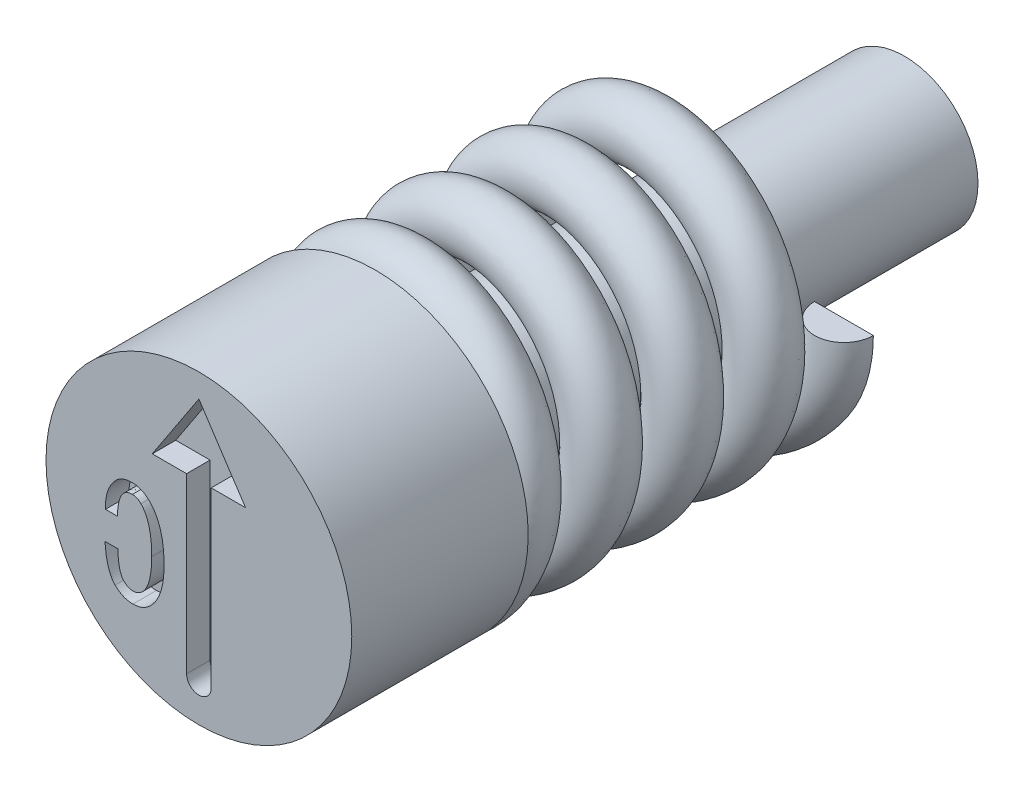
ISO-10303-21;
HEADER;
FILE_DESCRIPTION(('STEP AP214'),'2;1');
FILE_NAME('part.step','',(''),(''),'','','');
FILE_SCHEMA(('AUTOMOTIVE_DESIGN { 1 0 10303 214 1 1 1 1 }'));
ENDSEC;
DATA;
#1=APPLICATION_CONTEXT('core data for automotive mechanical design processes');
#2=APPLICATION_PROTOCOL_DEFINITION('international standard','automotive_design',2000,#1);
#3=PRODUCT_CONTEXT('',#1,'mechanical');
#4=PRODUCT('Part','Part','',(#3));
#5=PRODUCT_RELATED_PRODUCT_CATEGORY('part','',(#4));
#6=PRODUCT_DEFINITION_FORMATION('','',#4);
#7=PRODUCT_DEFINITION_CONTEXT('part definition',#1,'design');
#8=PRODUCT_DEFINITION('design','',#6,#7);
#9=PRODUCT_DEFINITION_SHAPE('','',#8);
#10=(LENGTH_UNIT() NAMED_UNIT(*) SI_UNIT(.MILLI.,.METRE.));
#11=(NAMED_UNIT(*) PLANE_ANGLE_UNIT() SI_UNIT($,.RADIAN.));
#12=(NAMED_UNIT(*) SI_UNIT($,.STERADIAN.) SOLID_ANGLE_UNIT());
#13=UNCERTAINTY_MEASURE_WITH_UNIT(LENGTH_MEASURE(1.E-05),#10,'distance_accuracy_value','');
#14=(GEOMETRIC_REPRESENTATION_CONTEXT(3) GLOBAL_UNCERTAINTY_ASSIGNED_CONTEXT((#13)) GLOBAL_UNIT_ASSIGNED_CONTEXT((#10,
#11,#12)) REPRESENTATION_CONTEXT('',''));
#15=CARTESIAN_POINT('',(0.,0.,0.));
#16=DIRECTION('',(0.,0.,1.));
#17=DIRECTION('',(1.,0.,0.));
#18=AXIS2_PLACEMENT_3D('',#15,#16,#17);
#19=CARTESIAN_POINT('',(2.1,0.,-9.37));
#20=DIRECTION('',(0.,-1.,0.));
#21=DIRECTION('',(0.,0.,-1.));
#22=AXIS2_PLACEMENT_3D('',#19,#20,#21);
#23=PLANE('',#22);
#24=CARTESIAN_POINT('',(2.1,0.,-8.87));
#25=DIRECTION('',(0.,1.,0.));
#26=DIRECTION('',(0.,0.,1.));
#27=AXIS2_PLACEMENT_3D('',#24,#25,#26);
#28=CIRCLE('',#27,0.5);
#29=CARTESIAN_POINT('',(1.6,0.,-8.87));
#30=VERTEX_POINT('',#29);
#31=CARTESIAN_POINT('',(2.6,0.,-8.87));
#32=VERTEX_POINT('',#31);
#33=EDGE_CURVE('E88',#30,#32,#28,.T.);
#34=ORIENTED_EDGE('',*,*,#33,.T.);
#35=DIRECTION('',(-1.,0.,0.));
#36=VECTOR('',#35,1.);
#37=CARTESIAN_POINT('',(2.1,0.,-8.87));
#38=LINE('',#37,#36);
#39=EDGE_CURVE('E75',#32,#30,#38,.T.);
#40=ORIENTED_EDGE('',*,*,#39,.T.);
#41=EDGE_LOOP('',(#34,#40));
#42=FACE_BOUND('',#41,.T.);
#43=ADVANCED_FACE('F49',(#42),#23,.F.);
#44=CARTESIAN_POINT('',(0.,-2.1,-3.5));
#45=DIRECTION('',(-1.,0.,0.));
#46=DIRECTION('',(0.,-1.,0.));
#47=AXIS2_PLACEMENT_3D('',#44,#45,#46);
#48=PLANE('',#47);
#49=DIRECTION('',(0.,-1.,0.));
#50=VECTOR('',#49,1.);
#51=CARTESIAN_POINT('',(0.,-2.1,-3.));
#52=LINE('',#51,#50);
#53=CARTESIAN_POINT('',(0.,-1.6,-3.));
#54=VERTEX_POINT('',#53);
#55=CARTESIAN_POINT('',(0.,-2.6,-3.));
#56=VERTEX_POINT('',#55);
#57=EDGE_CURVE('E69',#54,#56,#52,.T.);
#58=ORIENTED_EDGE('',*,*,#57,.F.);
#59=CARTESIAN_POINT('',(0.,-2.1,-3.));
#60=DIRECTION('',(-1.,0.,0.));
#61=DIRECTION('',(0.,-1.,0.));
#62=AXIS2_PLACEMENT_3D('',#59,#60,#61);
#63=CIRCLE('',#62,0.5);
#64=EDGE_CURVE('E85',#54,#56,#63,.T.);
#65=ORIENTED_EDGE('',*,*,#64,.T.);
#66=EDGE_LOOP('',(#58,#65));
#67=FACE_BOUND('',#66,.T.);
#68=ADVANCED_FACE('F51',(#67),#48,.T.);
#69=CARTESIAN_POINT('',(2.1,0.,-8.37));
#70=CARTESIAN_POINT('',(2.1,-0.8698484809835,-8.28367647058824));
#71=CARTESIAN_POINT('',(1.48492424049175,-1.48492424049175,-8.19735294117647));
#72=CARTESIAN_POINT('',(0.8698484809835,-2.1,-8.11102941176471));
#73=CARTESIAN_POINT('',(0.,-2.1,-8.02470588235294));
#74=CARTESIAN_POINT('',(-0.8698484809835,-2.1,-7.93838235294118));
#75=CARTESIAN_POINT('',(-1.48492424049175,-1.48492424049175,-7.85205882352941));
#76=CARTESIAN_POINT('',(-2.1,-0.8698484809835,-7.76573529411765));
#77=CARTESIAN_POINT('',(-2.1,0.,-7.67941176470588));
#78=CARTESIAN_POINT('',(-2.1,0.869848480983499,-7.59308823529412));
#79=CARTESIAN_POINT('',(-1.48492424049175,1.48492424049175,-7.50676470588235));
#80=CARTESIAN_POINT('',(-0.869848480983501,2.1,-7.42044117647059));
#81=CARTESIAN_POINT('',(0.,2.1,-7.33411764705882));
#82=CARTESIAN_POINT('',(0.8698484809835,2.1,-7.24779411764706));
#83=CARTESIAN_POINT('',(1.48492424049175,1.48492424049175,-7.1614705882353));
#84=CARTESIAN_POINT('',(2.1,0.869848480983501,-7.07514705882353));
#85=CARTESIAN_POINT('',(2.1,0.,-6.98882352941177));
#86=CARTESIAN_POINT('',(2.1,-0.8698484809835,-6.9025));
#87=CARTESIAN_POINT('',(1.48492424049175,-1.48492424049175,-6.81617647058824));
#88=CARTESIAN_POINT('',(0.8698484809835,-2.1,-6.72985294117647));
#89=CARTESIAN_POINT('',(0.,-2.1,-6.64352941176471));
#90=CARTESIAN_POINT('',(-0.8698484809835,-2.1,-6.55720588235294));
#91=CARTESIAN_POINT('',(-1.48492424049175,-1.48492424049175,-6.47088235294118));
#92=CARTESIAN_POINT('',(-2.1,-0.8698484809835,-6.38455882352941));
#93=CARTESIAN_POINT('',(-2.1,0.,-6.29823529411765));
#94=CARTESIAN_POINT('',(-2.1,0.869848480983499,-6.21191176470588));
#95=CARTESIAN_POINT('',(-1.48492424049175,1.48492424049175,-6.12558823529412));
#96=CARTESIAN_POINT('',(-0.869848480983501,2.1,-6.03926470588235));
#97=CARTESIAN_POINT('',(0.,2.1,-5.95294117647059));
#98=CARTESIAN_POINT('',(0.8698484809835,2.1,-5.86661764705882));
#99=CARTESIAN_POINT('',(1.48492424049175,1.48492424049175,-5.78029411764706));
#100=CARTESIAN_POINT('',(2.1,0.869848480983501,-5.6939705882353));
#101=CARTESIAN_POINT('',(2.1,0.,-5.60764705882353));
#102=CARTESIAN_POINT('',(2.1,-0.8698484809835,-5.52132352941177));
#103=CARTESIAN_POINT('',(1.48492424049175,-1.48492424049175,-5.435));
#104=CARTESIAN_POINT('',(0.8698484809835,-2.1,-5.34867647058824));
#105=CARTESIAN_POINT('',(0.,-2.1,-5.26235294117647));
#106=CARTESIAN_POINT('',(-0.8698484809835,-2.1,-5.17602941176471));
#107=CARTESIAN_POINT('',(-1.48492424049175,-1.48492424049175,-5.08970588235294));
#108=CARTESIAN_POINT('',(-2.1,-0.8698484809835,-5.00338235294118));
#109=CARTESIAN_POINT('',(-2.1,0.,-4.91705882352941));
#110=CARTESIAN_POINT('',(-2.1,0.869848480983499,-4.83073529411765));
#111=CARTESIAN_POINT('',(-1.48492424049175,1.48492424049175,-4.74441176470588));
#112=CARTESIAN_POINT('',(-0.869848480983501,2.1,-4.65808823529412));
#113=CARTESIAN_POINT('',(0.,2.1,-4.57176470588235));
#114=CARTESIAN_POINT('',(0.8698484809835,2.1,-4.48544117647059));
#115=CARTESIAN_POINT('',(1.48492424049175,1.48492424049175,-4.39911764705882));
#116=CARTESIAN_POINT('',(2.1,0.869848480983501,-4.31279411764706));
#117=CARTESIAN_POINT('',(2.1,0.,-4.2264705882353));
#118=CARTESIAN_POINT('',(2.1,-0.8698484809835,-4.14014705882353));
#119=CARTESIAN_POINT('',(1.48492424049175,-1.48492424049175,-4.05382352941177));
#120=CARTESIAN_POINT('',(0.8698484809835,-2.1,-3.9675));
#121=CARTESIAN_POINT('',(0.,-2.1,-3.88117647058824));
#122=CARTESIAN_POINT('',(-0.8698484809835,-2.1,-3.79485294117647));
#123=CARTESIAN_POINT('',(-1.48492424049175,-1.48492424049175,-3.70852941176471));
#124=CARTESIAN_POINT('',(-2.1,-0.8698484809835,-3.62220588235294));
#125=CARTESIAN_POINT('',(-2.1,0.,-3.53588235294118));
#126=CARTESIAN_POINT('',(-2.1,0.869848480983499,-3.44955882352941));
#127=CARTESIAN_POINT('',(-1.48492424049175,1.48492424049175,-3.36323529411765));
#128=CARTESIAN_POINT('',(-0.869848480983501,2.1,-3.27691176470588));
#129=CARTESIAN_POINT('',(0.,2.1,-3.19058823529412));
#130=CARTESIAN_POINT('',(0.8698484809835,2.1,-3.10426470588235));
#131=CARTESIAN_POINT('',(1.48492424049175,1.48492424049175,-3.01794117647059));
#132=CARTESIAN_POINT('',(2.1,0.869848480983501,-2.93161764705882));
#133=CARTESIAN_POINT('',(2.1,0.,-2.84529411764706));
#134=CARTESIAN_POINT('',(2.1,-0.8698484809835,-2.7589705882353));
#135=CARTESIAN_POINT('',(1.48492424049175,-1.48492424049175,-2.67264705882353));
#136=CARTESIAN_POINT('',(0.8698484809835,-2.1,-2.58632352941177));
#137=CARTESIAN_POINT('',(0.,-2.1,-2.5));
#138=CARTESIAN_POINT('',(3.1,0.,-8.37));
#139=CARTESIAN_POINT('',(3.1,-1.2840620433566,-8.28367647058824));
#140=CARTESIAN_POINT('',(2.1920310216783,-2.1920310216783,-8.19735294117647));
#141=CARTESIAN_POINT('',(1.2840620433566,-3.1,-8.11102941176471));
#142=CARTESIAN_POINT('',(0.,-3.1,-8.02470588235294));
#143=CARTESIAN_POINT('',(-1.28406204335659,-3.1,-7.93838235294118));
#144=CARTESIAN_POINT('',(-2.1920310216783,-2.1920310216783,-7.85205882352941));
#145=CARTESIAN_POINT('',(-3.1,-1.2840620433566,-7.76573529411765));
#146=CARTESIAN_POINT('',(-3.1,0.,-7.67941176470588));
#147=CARTESIAN_POINT('',(-3.1,1.28406204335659,-7.59308823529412));
#148=CARTESIAN_POINT('',(-2.1920310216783,2.1920310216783,-7.50676470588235));
#149=CARTESIAN_POINT('',(-1.2840620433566,3.1,-7.42044117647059));
#150=CARTESIAN_POINT('',(0.,3.1,-7.33411764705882));
#151=CARTESIAN_POINT('',(1.2840620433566,3.1,-7.24779411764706));
#152=CARTESIAN_POINT('',(2.1920310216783,2.1920310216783,-7.1614705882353));
#153=CARTESIAN_POINT('',(3.1,1.2840620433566,-7.07514705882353));
#154=CARTESIAN_POINT('',(3.1,0.,-6.98882352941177));
#155=CARTESIAN_POINT('',(3.1,-1.2840620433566,-6.9025));
#156=CARTESIAN_POINT('',(2.1920310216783,-2.1920310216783,-6.81617647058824));
#157=CARTESIAN_POINT('',(1.2840620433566,-3.1,-6.72985294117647));
#158=CARTESIAN_POINT('',(0.,-3.1,-6.64352941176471));
#159=CARTESIAN_POINT('',(-1.28406204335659,-3.1,-6.55720588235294));
#160=CARTESIAN_POINT('',(-2.1920310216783,-2.1920310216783,-6.47088235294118));
#161=CARTESIAN_POINT('',(-3.1,-1.2840620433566,-6.38455882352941));
#162=CARTESIAN_POINT('',(-3.1,0.,-6.29823529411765));
#163=CARTESIAN_POINT('',(-3.1,1.28406204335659,-6.21191176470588));
#164=CARTESIAN_POINT('',(-2.1920310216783,2.1920310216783,-6.12558823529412));
#165=CARTESIAN_POINT('',(-1.2840620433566,3.1,-6.03926470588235));
#166=CARTESIAN_POINT('',(0.,3.1,-5.95294117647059));
#167=CARTESIAN_POINT('',(1.2840620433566,3.1,-5.86661764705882));
#168=CARTESIAN_POINT('',(2.1920310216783,2.1920310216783,-5.78029411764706));
#169=CARTESIAN_POINT('',(3.1,1.2840620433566,-5.69397058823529));
#170=CARTESIAN_POINT('',(3.1,0.,-5.60764705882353));
#171=CARTESIAN_POINT('',(3.1,-1.2840620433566,-5.52132352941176));
#172=CARTESIAN_POINT('',(2.1920310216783,-2.1920310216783,-5.435));
#173=CARTESIAN_POINT('',(1.2840620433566,-3.1,-5.34867647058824));
#174=CARTESIAN_POINT('',(0.,-3.1,-5.26235294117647));
#175=CARTESIAN_POINT('',(-1.28406204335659,-3.1,-5.17602941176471));
#176=CARTESIAN_POINT('',(-2.1920310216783,-2.1920310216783,-5.08970588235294));
#177=CARTESIAN_POINT('',(-3.1,-1.2840620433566,-5.00338235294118));
#178=CARTESIAN_POINT('',(-3.1,0.,-4.91705882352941));
#179=CARTESIAN_POINT('',(-3.1,1.28406204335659,-4.83073529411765));
#180=CARTESIAN_POINT('',(-2.1920310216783,2.1920310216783,-4.74441176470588));
#181=CARTESIAN_POINT('',(-1.2840620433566,3.1,-4.65808823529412));
#182=CARTESIAN_POINT('',(0.,3.1,-4.57176470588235));
#183=CARTESIAN_POINT('',(1.2840620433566,3.1,-4.48544117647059));
#184=CARTESIAN_POINT('',(2.1920310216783,2.1920310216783,-4.39911764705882));
#185=CARTESIAN_POINT('',(3.1,1.2840620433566,-4.31279411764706));
#186=CARTESIAN_POINT('',(3.1,0.,-4.2264705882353));
#187=CARTESIAN_POINT('',(3.1,-1.2840620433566,-4.14014705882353));
#188=CARTESIAN_POINT('',(2.1920310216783,-2.1920310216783,-4.05382352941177));
#189=CARTESIAN_POINT('',(1.2840620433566,-3.1,-3.9675));
#190=CARTESIAN_POINT('',(0.,-3.1,-3.88117647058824));
#191=CARTESIAN_POINT('',(-1.28406204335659,-3.1,-3.79485294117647));
#192=CARTESIAN_POINT('',(-2.1920310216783,-2.1920310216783,-3.70852941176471));
#193=CARTESIAN_POINT('',(-3.1,-1.2840620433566,-3.62220588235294));
#194=CARTESIAN_POINT('',(-3.1,0.,-3.53588235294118));
#195=CARTESIAN_POINT('',(-3.1,1.28406204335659,-3.44955882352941));
#196=CARTESIAN_POINT('',(-2.1920310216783,2.1920310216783,-3.36323529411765));
#197=CARTESIAN_POINT('',(-1.2840620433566,3.1,-3.27691176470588));
#198=CARTESIAN_POINT('',(0.,3.1,-3.19058823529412));
#199=CARTESIAN_POINT('',(1.2840620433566,3.1,-3.10426470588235));
#200=CARTESIAN_POINT('',(2.1920310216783,2.1920310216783,-3.01794117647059));
#201=CARTESIAN_POINT('',(3.1,1.2840620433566,-2.93161764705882));
#202=CARTESIAN_POINT('',(3.1,0.,-2.84529411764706));
#203=CARTESIAN_POINT('',(3.1,-1.2840620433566,-2.75897058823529));
#204=CARTESIAN_POINT('',(2.1920310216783,-2.1920310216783,-2.67264705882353));
#205=CARTESIAN_POINT('',(1.2840620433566,-3.1,-2.58632352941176));
#206=CARTESIAN_POINT('',(0.,-3.1,-2.5));
#207=CARTESIAN_POINT('',(3.1,0.,-9.37));
#208=CARTESIAN_POINT('',(3.1,-1.2840620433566,-9.28367647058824));
#209=CARTESIAN_POINT('',(2.1920310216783,-2.1920310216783,-9.19735294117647));
#210=CARTESIAN_POINT('',(1.2840620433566,-3.1,-9.11102941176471));
#211=CARTESIAN_POINT('',(0.,-3.1,-9.02470588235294));
#212=CARTESIAN_POINT('',(-1.28406204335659,-3.1,-8.93838235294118));
#213=CARTESIAN_POINT('',(-2.1920310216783,-2.1920310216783,-8.85205882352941));
#214=CARTESIAN_POINT('',(-3.1,-1.2840620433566,-8.76573529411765));
#215=CARTESIAN_POINT('',(-3.1,0.,-8.67941176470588));
#216=CARTESIAN_POINT('',(-3.1,1.28406204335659,-8.59308823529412));
#217=CARTESIAN_POINT('',(-2.1920310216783,2.1920310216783,-8.50676470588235));
#218=CARTESIAN_POINT('',(-1.2840620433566,3.1,-8.42044117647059));
#219=CARTESIAN_POINT('',(0.,3.1,-8.33411764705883));
#220=CARTESIAN_POINT('',(1.2840620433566,3.1,-8.24779411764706));
#221=CARTESIAN_POINT('',(2.1920310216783,2.1920310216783,-8.16147058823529));
#222=CARTESIAN_POINT('',(3.1,1.2840620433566,-8.07514705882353));
#223=CARTESIAN_POINT('',(3.1,0.,-7.98882352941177));
#224=CARTESIAN_POINT('',(3.1,-1.2840620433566,-7.9025));
#225=CARTESIAN_POINT('',(2.1920310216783,-2.1920310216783,-7.81617647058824));
#226=CARTESIAN_POINT('',(1.2840620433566,-3.1,-7.72985294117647));
#227=CARTESIAN_POINT('',(0.,-3.1,-7.64352941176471));
#228=CARTESIAN_POINT('',(-1.28406204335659,-3.1,-7.55720588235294));
#229=CARTESIAN_POINT('',(-2.1920310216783,-2.1920310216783,-7.47088235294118));
#230=CARTESIAN_POINT('',(-3.1,-1.2840620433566,-7.38455882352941));
#231=CARTESIAN_POINT('',(-3.1,0.,-7.29823529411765));
#232=CARTESIAN_POINT('',(-3.1,1.28406204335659,-7.21191176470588));
#233=CARTESIAN_POINT('',(-2.1920310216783,2.1920310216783,-7.12558823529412));
#234=CARTESIAN_POINT('',(-1.2840620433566,3.1,-7.03926470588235));
#235=CARTESIAN_POINT('',(0.,3.1,-6.95294117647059));
#236=CARTESIAN_POINT('',(1.2840620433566,3.1,-6.86661764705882));
#237=CARTESIAN_POINT('',(2.1920310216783,2.1920310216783,-6.78029411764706));
#238=CARTESIAN_POINT('',(3.1,1.2840620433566,-6.6939705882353));
#239=CARTESIAN_POINT('',(3.1,0.,-6.60764705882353));
#240=CARTESIAN_POINT('',(3.1,-1.2840620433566,-6.52132352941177));
#241=CARTESIAN_POINT('',(2.1920310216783,-2.1920310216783,-6.435));
#242=CARTESIAN_POINT('',(1.2840620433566,-3.1,-6.34867647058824));
#243=CARTESIAN_POINT('',(0.,-3.1,-6.26235294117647));
#244=CARTESIAN_POINT('',(-1.28406204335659,-3.1,-6.17602941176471));
#245=CARTESIAN_POINT('',(-2.1920310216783,-2.1920310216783,-6.08970588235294));
#246=CARTESIAN_POINT('',(-3.1,-1.2840620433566,-6.00338235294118));
#247=CARTESIAN_POINT('',(-3.1,0.,-5.91705882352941));
#248=CARTESIAN_POINT('',(-3.1,1.28406204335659,-5.83073529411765));
#249=CARTESIAN_POINT('',(-2.1920310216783,2.1920310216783,-5.74441176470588));
#250=CARTESIAN_POINT('',(-1.2840620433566,3.1,-5.65808823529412));
#251=CARTESIAN_POINT('',(0.,3.1,-5.57176470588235));
#252=CARTESIAN_POINT('',(1.2840620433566,3.1,-5.48544117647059));
#253=CARTESIAN_POINT('',(2.1920310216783,2.1920310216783,-5.39911764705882));
#254=CARTESIAN_POINT('',(3.1,1.2840620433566,-5.31279411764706));
#255=CARTESIAN_POINT('',(3.1,0.,-5.2264705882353));
#256=CARTESIAN_POINT('',(3.1,-1.2840620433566,-5.14014705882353));
#257=CARTESIAN_POINT('',(2.1920310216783,-2.1920310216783,-5.05382352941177));
#258=CARTESIAN_POINT('',(1.2840620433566,-3.1,-4.9675));
#259=CARTESIAN_POINT('',(0.,-3.1,-4.88117647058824));
#260=CARTESIAN_POINT('',(-1.28406204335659,-3.1,-4.79485294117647));
#261=CARTESIAN_POINT('',(-2.1920310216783,-2.1920310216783,-4.70852941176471));
#262=CARTESIAN_POINT('',(-3.1,-1.2840620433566,-4.62220588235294));
#263=CARTESIAN_POINT('',(-3.1,0.,-4.53588235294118));
#264=CARTESIAN_POINT('',(-3.1,1.28406204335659,-4.44955882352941));
#265=CARTESIAN_POINT('',(-2.1920310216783,2.1920310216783,-4.36323529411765));
#266=CARTESIAN_POINT('',(-1.2840620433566,3.1,-4.27691176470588));
#267=CARTESIAN_POINT('',(0.,3.1,-4.19058823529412));
#268=CARTESIAN_POINT('',(1.2840620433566,3.1,-4.10426470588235));
#269=CARTESIAN_POINT('',(2.1920310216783,2.1920310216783,-4.01794117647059));
#270=CARTESIAN_POINT('',(3.1,1.2840620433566,-3.93161764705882));
#271=CARTESIAN_POINT('',(3.1,0.,-3.84529411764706));
#272=CARTESIAN_POINT('',(3.1,-1.2840620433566,-3.7589705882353));
#273=CARTESIAN_POINT('',(2.1920310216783,-2.1920310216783,-3.67264705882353));
#274=CARTESIAN_POINT('',(1.2840620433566,-3.1,-3.58632352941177));
#275=CARTESIAN_POINT('',(0.,-3.1,-3.5));
#276=CARTESIAN_POINT('',(2.1,0.,-9.37));
#277=CARTESIAN_POINT('',(2.1,-0.8698484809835,-9.28367647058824));
#278=CARTESIAN_POINT('',(1.48492424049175,-1.48492424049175,-9.19735294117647));
#279=CARTESIAN_POINT('',(0.8698484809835,-2.1,-9.11102941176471));
#280=CARTESIAN_POINT('',(0.,-2.1,-9.02470588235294));
#281=CARTESIAN_POINT('',(-0.8698484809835,-2.1,-8.93838235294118));
#282=CARTESIAN_POINT('',(-1.48492424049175,-1.48492424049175,-8.85205882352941));
#283=CARTESIAN_POINT('',(-2.1,-0.8698484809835,-8.76573529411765));
#284=CARTESIAN_POINT('',(-2.1,0.,-8.67941176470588));
#285=CARTESIAN_POINT('',(-2.1,0.869848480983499,-8.59308823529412));
#286=CARTESIAN_POINT('',(-1.48492424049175,1.48492424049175,-8.50676470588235));
#287=CARTESIAN_POINT('',(-0.869848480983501,2.1,-8.42044117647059));
#288=CARTESIAN_POINT('',(0.,2.1,-8.33411764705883));
#289=CARTESIAN_POINT('',(0.8698484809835,2.1,-8.24779411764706));
#290=CARTESIAN_POINT('',(1.48492424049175,1.48492424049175,-8.1614705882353));
#291=CARTESIAN_POINT('',(2.1,0.869848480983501,-8.07514705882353));
#292=CARTESIAN_POINT('',(2.1,0.,-7.98882352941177));
#293=CARTESIAN_POINT('',(2.1,-0.8698484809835,-7.9025));
#294=CARTESIAN_POINT('',(1.48492424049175,-1.48492424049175,-7.81617647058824));
#295=CARTESIAN_POINT('',(0.8698484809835,-2.1,-7.72985294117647));
#296=CARTESIAN_POINT('',(0.,-2.1,-7.64352941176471));
#297=CARTESIAN_POINT('',(-0.8698484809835,-2.1,-7.55720588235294));
#298=CARTESIAN_POINT('',(-1.48492424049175,-1.48492424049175,-7.47088235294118));
#299=CARTESIAN_POINT('',(-2.1,-0.8698484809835,-7.38455882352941));
#300=CARTESIAN_POINT('',(-2.1,0.,-7.29823529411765));
#301=CARTESIAN_POINT('',(-2.1,0.869848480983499,-7.21191176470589));
#302=CARTESIAN_POINT('',(-1.48492424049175,1.48492424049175,-7.12558823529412));
#303=CARTESIAN_POINT('',(-0.869848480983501,2.1,-7.03926470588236));
#304=CARTESIAN_POINT('',(0.,2.1,-6.95294117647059));
#305=CARTESIAN_POINT('',(0.8698484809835,2.1,-6.86661764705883));
#306=CARTESIAN_POINT('',(1.48492424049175,1.48492424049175,-6.78029411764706));
#307=CARTESIAN_POINT('',(2.1,0.869848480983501,-6.6939705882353));
#308=CARTESIAN_POINT('',(2.1,0.,-6.60764705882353));
#309=CARTESIAN_POINT('',(2.1,-0.8698484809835,-6.52132352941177));
#310=CARTESIAN_POINT('',(1.48492424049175,-1.48492424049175,-6.435));
#311=CARTESIAN_POINT('',(0.8698484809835,-2.1,-6.34867647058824));
#312=CARTESIAN_POINT('',(0.,-2.1,-6.26235294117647));
#313=CARTESIAN_POINT('',(-0.8698484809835,-2.1,-6.17602941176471));
#314=CARTESIAN_POINT('',(-1.48492424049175,-1.48492424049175,-6.08970588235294));
#315=CARTESIAN_POINT('',(-2.1,-0.8698484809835,-6.00338235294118));
#316=CARTESIAN_POINT('',(-2.1,0.,-5.91705882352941));
#317=CARTESIAN_POINT('',(-2.1,0.869848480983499,-5.83073529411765));
#318=CARTESIAN_POINT('',(-1.48492424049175,1.48492424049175,-5.74441176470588));
#319=CARTESIAN_POINT('',(-0.869848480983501,2.1,-5.65808823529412));
#320=CARTESIAN_POINT('',(0.,2.1,-5.57176470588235));
#321=CARTESIAN_POINT('',(0.8698484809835,2.1,-5.48544117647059));
#322=CARTESIAN_POINT('',(1.48492424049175,1.48492424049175,-5.39911764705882));
#323=CARTESIAN_POINT('',(2.1,0.869848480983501,-5.31279411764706));
#324=CARTESIAN_POINT('',(2.1,0.,-5.2264705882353));
#325=CARTESIAN_POINT('',(2.1,-0.8698484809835,-5.14014705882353));
#326=CARTESIAN_POINT('',(1.48492424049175,-1.48492424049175,-5.05382352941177));
#327=CARTESIAN_POINT('',(0.8698484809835,-2.1,-4.9675));
#328=CARTESIAN_POINT('',(0.,-2.1,-4.88117647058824));
#329=CARTESIAN_POINT('',(-0.8698484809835,-2.1,-4.79485294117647));
#330=CARTESIAN_POINT('',(-1.48492424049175,-1.48492424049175,-4.70852941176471));
#331=CARTESIAN_POINT('',(-2.1,-0.8698484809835,-4.62220588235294));
#332=CARTESIAN_POINT('',(-2.1,0.,-4.53588235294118));
#333=CARTESIAN_POINT('',(-2.1,0.869848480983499,-4.44955882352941));
#334=CARTESIAN_POINT('',(-1.48492424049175,1.48492424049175,-4.36323529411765));
#335=CARTESIAN_POINT('',(-0.869848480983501,2.1,-4.27691176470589));
#336=CARTESIAN_POINT('',(0.,2.1,-4.19058823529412));
#337=CARTESIAN_POINT('',(0.8698484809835,2.1,-4.10426470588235));
#338=CARTESIAN_POINT('',(1.48492424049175,1.48492424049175,-4.01794117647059));
#339=CARTESIAN_POINT('',(2.1,0.869848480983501,-3.93161764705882));
#340=CARTESIAN_POINT('',(2.1,0.,-3.84529411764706));
#341=CARTESIAN_POINT('',(2.1,-0.8698484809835,-3.7589705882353));
#342=CARTESIAN_POINT('',(1.48492424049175,-1.48492424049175,-3.67264705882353));
#343=CARTESIAN_POINT('',(0.8698484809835,-2.1,-3.58632352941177));
#344=CARTESIAN_POINT('',(0.,-2.1,-3.5));
#345=CARTESIAN_POINT('',(1.1,0.,-9.37));
#346=CARTESIAN_POINT('',(1.1,-0.455634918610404,-9.28367647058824));
#347=CARTESIAN_POINT('',(0.777817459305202,-0.777817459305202,-9.19735294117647));
#348=CARTESIAN_POINT('',(0.455634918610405,-1.1,-9.11102941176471));
#349=CARTESIAN_POINT('',(0.,-1.1,-9.02470588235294));
#350=CARTESIAN_POINT('',(-0.455634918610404,-1.1,-8.93838235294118));
#351=CARTESIAN_POINT('',(-0.777817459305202,-0.777817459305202,-8.85205882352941));
#352=CARTESIAN_POINT('',(-1.1,-0.455634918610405,-8.76573529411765));
#353=CARTESIAN_POINT('',(-1.1,0.,-8.67941176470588));
#354=CARTESIAN_POINT('',(-1.1,0.455634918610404,-8.59308823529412));
#355=CARTESIAN_POINT('',(-0.777817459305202,0.777817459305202,-8.50676470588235));
#356=CARTESIAN_POINT('',(-0.455634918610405,1.1,-8.42044117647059));
#357=CARTESIAN_POINT('',(0.,1.1,-8.33411764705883));
#358=CARTESIAN_POINT('',(0.455634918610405,1.1,-8.24779411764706));
#359=CARTESIAN_POINT('',(0.777817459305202,0.777817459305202,-8.16147058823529));
#360=CARTESIAN_POINT('',(1.1,0.455634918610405,-8.07514705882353));
#361=CARTESIAN_POINT('',(1.1,0.,-7.98882352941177));
#362=CARTESIAN_POINT('',(1.1,-0.455634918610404,-7.9025));
#363=CARTESIAN_POINT('',(0.777817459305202,-0.777817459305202,-7.81617647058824));
#364=CARTESIAN_POINT('',(0.455634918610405,-1.1,-7.72985294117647));
#365=CARTESIAN_POINT('',(0.,-1.1,-7.64352941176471));
#366=CARTESIAN_POINT('',(-0.455634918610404,-1.1,-7.55720588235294));
#367=CARTESIAN_POINT('',(-0.777817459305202,-0.777817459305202,-7.47088235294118));
#368=CARTESIAN_POINT('',(-1.1,-0.455634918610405,-7.38455882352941));
#369=CARTESIAN_POINT('',(-1.1,0.,-7.29823529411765));
#370=CARTESIAN_POINT('',(-1.1,0.455634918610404,-7.21191176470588));
#371=CARTESIAN_POINT('',(-0.777817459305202,0.777817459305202,-7.12558823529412));
#372=CARTESIAN_POINT('',(-0.455634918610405,1.1,-7.03926470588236));
#373=CARTESIAN_POINT('',(0.,1.1,-6.95294117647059));
#374=CARTESIAN_POINT('',(0.455634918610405,1.1,-6.86661764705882));
#375=CARTESIAN_POINT('',(0.777817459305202,0.777817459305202,-6.78029411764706));
#376=CARTESIAN_POINT('',(1.1,0.455634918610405,-6.6939705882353));
#377=CARTESIAN_POINT('',(1.1,0.,-6.60764705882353));
#378=CARTESIAN_POINT('',(1.1,-0.455634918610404,-6.52132352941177));
#379=CARTESIAN_POINT('',(0.777817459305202,-0.777817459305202,-6.435));
#380=CARTESIAN_POINT('',(0.455634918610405,-1.1,-6.34867647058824));
#381=CARTESIAN_POINT('',(0.,-1.1,-6.26235294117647));
#382=CARTESIAN_POINT('',(-0.455634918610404,-1.1,-6.17602941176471));
#383=CARTESIAN_POINT('',(-0.777817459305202,-0.777817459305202,-6.08970588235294));
#384=CARTESIAN_POINT('',(-1.1,-0.455634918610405,-6.00338235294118));
#385=CARTESIAN_POINT('',(-1.1,0.,-5.91705882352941));
#386=CARTESIAN_POINT('',(-1.1,0.455634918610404,-5.83073529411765));
#387=CARTESIAN_POINT('',(-0.777817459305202,0.777817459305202,-5.74441176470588));
#388=CARTESIAN_POINT('',(-0.455634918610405,1.1,-5.65808823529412));
#389=CARTESIAN_POINT('',(0.,1.1,-5.57176470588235));
#390=CARTESIAN_POINT('',(0.455634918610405,1.1,-5.48544117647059));
#391=CARTESIAN_POINT('',(0.777817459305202,0.777817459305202,-5.39911764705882));
#392=CARTESIAN_POINT('',(1.1,0.455634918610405,-5.31279411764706));
#393=CARTESIAN_POINT('',(1.1,0.,-5.2264705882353));
#394=CARTESIAN_POINT('',(1.1,-0.455634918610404,-5.14014705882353));
#395=CARTESIAN_POINT('',(0.777817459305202,-0.777817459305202,-5.05382352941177));
#396=CARTESIAN_POINT('',(0.455634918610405,-1.1,-4.9675));
#397=CARTESIAN_POINT('',(0.,-1.1,-4.88117647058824));
#398=CARTESIAN_POINT('',(-0.455634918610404,-1.1,-4.79485294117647));
#399=CARTESIAN_POINT('',(-0.777817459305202,-0.777817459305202,-4.70852941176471));
#400=CARTESIAN_POINT('',(-1.1,-0.455634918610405,-4.62220588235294));
#401=CARTESIAN_POINT('',(-1.1,0.,-4.53588235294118));
#402=CARTESIAN_POINT('',(-1.1,0.455634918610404,-4.44955882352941));
#403=CARTESIAN_POINT('',(-0.777817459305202,0.777817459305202,-4.36323529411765));
#404=CARTESIAN_POINT('',(-0.455634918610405,1.1,-4.27691176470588));
#405=CARTESIAN_POINT('',(0.,1.1,-4.19058823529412));
#406=CARTESIAN_POINT('',(0.455634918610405,1.1,-4.10426470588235));
#407=CARTESIAN_POINT('',(0.777817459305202,0.777817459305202,-4.01794117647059));
#408=CARTESIAN_POINT('',(1.1,0.455634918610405,-3.93161764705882));
#409=CARTESIAN_POINT('',(1.1,0.,-3.84529411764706));
#410=CARTESIAN_POINT('',(1.1,-0.455634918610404,-3.7589705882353));
#411=CARTESIAN_POINT('',(0.777817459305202,-0.777817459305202,-3.67264705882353));
#412=CARTESIAN_POINT('',(0.455634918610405,-1.1,-3.58632352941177));
#413=CARTESIAN_POINT('',(0.,-1.1,-3.5));
#414=CARTESIAN_POINT('',(1.1,0.,-8.37));
#415=CARTESIAN_POINT('',(1.1,-0.455634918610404,-8.28367647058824));
#416=CARTESIAN_POINT('',(0.777817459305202,-0.777817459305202,-8.19735294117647));
#417=CARTESIAN_POINT('',(0.455634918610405,-1.1,-8.11102941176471));
#418=CARTESIAN_POINT('',(0.,-1.1,-8.02470588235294));
#419=CARTESIAN_POINT('',(-0.455634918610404,-1.1,-7.93838235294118));
#420=CARTESIAN_POINT('',(-0.777817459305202,-0.777817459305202,-7.85205882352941));
#421=CARTESIAN_POINT('',(-1.1,-0.455634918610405,-7.76573529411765));
#422=CARTESIAN_POINT('',(-1.1,0.,-7.67941176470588));
#423=CARTESIAN_POINT('',(-1.1,0.455634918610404,-7.59308823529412));
#424=CARTESIAN_POINT('',(-0.777817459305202,0.777817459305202,-7.50676470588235));
#425=CARTESIAN_POINT('',(-0.455634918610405,1.1,-7.42044117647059));
#426=CARTESIAN_POINT('',(0.,1.1,-7.33411764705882));
#427=CARTESIAN_POINT('',(0.455634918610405,1.1,-7.24779411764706));
#428=CARTESIAN_POINT('',(0.777817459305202,0.777817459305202,-7.1614705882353));
#429=CARTESIAN_POINT('',(1.1,0.455634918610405,-7.07514705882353));
#430=CARTESIAN_POINT('',(1.1,0.,-6.98882352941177));
#431=CARTESIAN_POINT('',(1.1,-0.455634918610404,-6.9025));
#432=CARTESIAN_POINT('',(0.777817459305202,-0.777817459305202,-6.81617647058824));
#433=CARTESIAN_POINT('',(0.455634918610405,-1.1,-6.72985294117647));
#434=CARTESIAN_POINT('',(0.,-1.1,-6.64352941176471));
#435=CARTESIAN_POINT('',(-0.455634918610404,-1.1,-6.55720588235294));
#436=CARTESIAN_POINT('',(-0.777817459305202,-0.777817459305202,-6.47088235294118));
#437=CARTESIAN_POINT('',(-1.1,-0.455634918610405,-6.38455882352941));
#438=CARTESIAN_POINT('',(-1.1,0.,-6.29823529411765));
#439=CARTESIAN_POINT('',(-1.1,0.455634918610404,-6.21191176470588));
#440=CARTESIAN_POINT('',(-0.777817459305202,0.777817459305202,-6.12558823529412));
#441=CARTESIAN_POINT('',(-0.455634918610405,1.1,-6.03926470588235));
#442=CARTESIAN_POINT('',(0.,1.1,-5.95294117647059));
#443=CARTESIAN_POINT('',(0.455634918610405,1.1,-5.86661764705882));
#444=CARTESIAN_POINT('',(0.777817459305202,0.777817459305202,-5.78029411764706));
#445=CARTESIAN_POINT('',(1.1,0.455634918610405,-5.69397058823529));
#446=CARTESIAN_POINT('',(1.1,0.,-5.60764705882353));
#447=CARTESIAN_POINT('',(1.1,-0.455634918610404,-5.52132352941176));
#448=CARTESIAN_POINT('',(0.777817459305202,-0.777817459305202,-5.435));
#449=CARTESIAN_POINT('',(0.455634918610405,-1.1,-5.34867647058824));
#450=CARTESIAN_POINT('',(0.,-1.1,-5.26235294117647));
#451=CARTESIAN_POINT('',(-0.455634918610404,-1.1,-5.17602941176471));
#452=CARTESIAN_POINT('',(-0.777817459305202,-0.777817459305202,-5.08970588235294));
#453=CARTESIAN_POINT('',(-1.1,-0.455634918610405,-5.00338235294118));
#454=CARTESIAN_POINT('',(-1.1,0.,-4.91705882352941));
#455=CARTESIAN_POINT('',(-1.1,0.455634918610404,-4.83073529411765));
#456=CARTESIAN_POINT('',(-0.777817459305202,0.777817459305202,-4.74441176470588));
#457=CARTESIAN_POINT('',(-0.455634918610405,1.1,-4.65808823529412));
#458=CARTESIAN_POINT('',(0.,1.1,-4.57176470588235));
#459=CARTESIAN_POINT('',(0.455634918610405,1.1,-4.48544117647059));
#460=CARTESIAN_POINT('',(0.777817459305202,0.777817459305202,-4.39911764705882));
#461=CARTESIAN_POINT('',(1.1,0.455634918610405,-4.31279411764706));
#462=CARTESIAN_POINT('',(1.1,0.,-4.2264705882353));
#463=CARTESIAN_POINT('',(1.1,-0.455634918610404,-4.14014705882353));
#464=CARTESIAN_POINT('',(0.777817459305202,-0.777817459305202,-4.05382352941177));
#465=CARTESIAN_POINT('',(0.455634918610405,-1.1,-3.9675));
#466=CARTESIAN_POINT('',(0.,-1.1,-3.88117647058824));
#467=CARTESIAN_POINT('',(-0.455634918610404,-1.1,-3.79485294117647));
#468=CARTESIAN_POINT('',(-0.777817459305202,-0.777817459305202,-3.70852941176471));
#469=CARTESIAN_POINT('',(-1.1,-0.455634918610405,-3.62220588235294));
#470=CARTESIAN_POINT('',(-1.1,0.,-3.53588235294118));
#471=CARTESIAN_POINT('',(-1.1,0.455634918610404,-3.44955882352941));
#472=CARTESIAN_POINT('',(-0.777817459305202,0.777817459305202,-3.36323529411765));
#473=CARTESIAN_POINT('',(-0.455634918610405,1.1,-3.27691176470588));
#474=CARTESIAN_POINT('',(0.,1.1,-3.19058823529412));
#475=CARTESIAN_POINT('',(0.455634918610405,1.1,-3.10426470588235));
#476=CARTESIAN_POINT('',(0.777817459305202,0.777817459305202,-3.01794117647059));
#477=CARTESIAN_POINT('',(1.1,0.455634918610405,-2.93161764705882));
#478=CARTESIAN_POINT('',(1.1,0.,-2.84529411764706));
#479=CARTESIAN_POINT('',(1.1,-0.455634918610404,-2.75897058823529));
#480=CARTESIAN_POINT('',(0.777817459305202,-0.777817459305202,-2.67264705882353));
#481=CARTESIAN_POINT('',(0.455634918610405,-1.1,-2.58632352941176));
#482=CARTESIAN_POINT('',(0.,-1.1,-2.5));
#483=CARTESIAN_POINT('',(2.1,0.,-8.37));
#484=CARTESIAN_POINT('',(2.1,-0.8698484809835,-8.28367647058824));
#485=CARTESIAN_POINT('',(1.48492424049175,-1.48492424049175,-8.19735294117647));
#486=CARTESIAN_POINT('',(0.8698484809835,-2.1,-8.11102941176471));
#487=CARTESIAN_POINT('',(0.,-2.1,-8.02470588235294));
#488=CARTESIAN_POINT('',(-0.8698484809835,-2.1,-7.93838235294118));
#489=CARTESIAN_POINT('',(-1.48492424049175,-1.48492424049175,-7.85205882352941));
#490=CARTESIAN_POINT('',(-2.1,-0.8698484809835,-7.76573529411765));
#491=CARTESIAN_POINT('',(-2.1,0.,-7.67941176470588));
#492=CARTESIAN_POINT('',(-2.1,0.869848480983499,-7.59308823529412));
#493=CARTESIAN_POINT('',(-1.48492424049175,1.48492424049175,-7.50676470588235));
#494=CARTESIAN_POINT('',(-0.869848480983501,2.1,-7.42044117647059));
#495=CARTESIAN_POINT('',(0.,2.1,-7.33411764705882));
#496=CARTESIAN_POINT('',(0.8698484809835,2.1,-7.24779411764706));
#497=CARTESIAN_POINT('',(1.48492424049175,1.48492424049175,-7.1614705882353));
#498=CARTESIAN_POINT('',(2.1,0.869848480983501,-7.07514705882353));
#499=CARTESIAN_POINT('',(2.1,0.,-6.98882352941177));
#500=CARTESIAN_POINT('',(2.1,-0.8698484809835,-6.9025));
#501=CARTESIAN_POINT('',(1.48492424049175,-1.48492424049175,-6.81617647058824));
#502=CARTESIAN_POINT('',(0.8698484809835,-2.1,-6.72985294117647));
#503=CARTESIAN_POINT('',(0.,-2.1,-6.64352941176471));
#504=CARTESIAN_POINT('',(-0.8698484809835,-2.1,-6.55720588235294));
#505=CARTESIAN_POINT('',(-1.48492424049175,-1.48492424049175,-6.47088235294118));
#506=CARTESIAN_POINT('',(-2.1,-0.8698484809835,-6.38455882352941));
#507=CARTESIAN_POINT('',(-2.1,0.,-6.29823529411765));
#508=CARTESIAN_POINT('',(-2.1,0.869848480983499,-6.21191176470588));
#509=CARTESIAN_POINT('',(-1.48492424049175,1.48492424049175,-6.12558823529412));
#510=CARTESIAN_POINT('',(-0.869848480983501,2.1,-6.03926470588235));
#511=CARTESIAN_POINT('',(0.,2.1,-5.95294117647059));
#512=CARTESIAN_POINT('',(0.8698484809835,2.1,-5.86661764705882));
#513=CARTESIAN_POINT('',(1.48492424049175,1.48492424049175,-5.78029411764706));
#514=CARTESIAN_POINT('',(2.1,0.869848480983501,-5.6939705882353));
#515=CARTESIAN_POINT('',(2.1,0.,-5.60764705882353));
#516=CARTESIAN_POINT('',(2.1,-0.8698484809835,-5.52132352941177));
#517=CARTESIAN_POINT('',(1.48492424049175,-1.48492424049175,-5.435));
#518=CARTESIAN_POINT('',(0.8698484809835,-2.1,-5.34867647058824));
#519=CARTESIAN_POINT('',(0.,-2.1,-5.26235294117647));
#520=CARTESIAN_POINT('',(-0.8698484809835,-2.1,-5.17602941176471));
#521=CARTESIAN_POINT('',(-1.48492424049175,-1.48492424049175,-5.08970588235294));
#522=CARTESIAN_POINT('',(-2.1,-0.8698484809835,-5.00338235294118));
#523=CARTESIAN_POINT('',(-2.1,0.,-4.91705882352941));
#524=CARTESIAN_POINT('',(-2.1,0.869848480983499,-4.83073529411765));
#525=CARTESIAN_POINT('',(-1.48492424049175,1.48492424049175,-4.74441176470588));
#526=CARTESIAN_POINT('',(-0.869848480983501,2.1,-4.65808823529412));
#527=CARTESIAN_POINT('',(0.,2.1,-4.57176470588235));
#528=CARTESIAN_POINT('',(0.8698484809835,2.1,-4.48544117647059));
#529=CARTESIAN_POINT('',(1.48492424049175,1.48492424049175,-4.39911764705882));
#530=CARTESIAN_POINT('',(2.1,0.869848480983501,-4.31279411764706));
#531=CARTESIAN_POINT('',(2.1,0.,-4.2264705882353));
#532=CARTESIAN_POINT('',(2.1,-0.8698484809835,-4.14014705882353));
#533=CARTESIAN_POINT('',(1.48492424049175,-1.48492424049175,-4.05382352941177));
#534=CARTESIAN_POINT('',(0.8698484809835,-2.1,-3.9675));
#535=CARTESIAN_POINT('',(0.,-2.1,-3.88117647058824));
#536=CARTESIAN_POINT('',(-0.8698484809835,-2.1,-3.79485294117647));
#537=CARTESIAN_POINT('',(-1.48492424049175,-1.48492424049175,-3.70852941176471));
#538=CARTESIAN_POINT('',(-2.1,-0.8698484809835,-3.62220588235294));
#539=CARTESIAN_POINT('',(-2.1,0.,-3.53588235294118));
#540=CARTESIAN_POINT('',(-2.1,0.869848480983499,-3.44955882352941));
#541=CARTESIAN_POINT('',(-1.48492424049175,1.48492424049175,-3.36323529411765));
#542=CARTESIAN_POINT('',(-0.869848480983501,2.1,-3.27691176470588));
#543=CARTESIAN_POINT('',(0.,2.1,-3.19058823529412));
#544=CARTESIAN_POINT('',(0.8698484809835,2.1,-3.10426470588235));
#545=CARTESIAN_POINT('',(1.48492424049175,1.48492424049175,-3.01794117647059));
#546=CARTESIAN_POINT('',(2.1,0.869848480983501,-2.93161764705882));
#547=CARTESIAN_POINT('',(2.1,0.,-2.84529411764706));
#548=CARTESIAN_POINT('',(2.1,-0.8698484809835,-2.7589705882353));
#549=CARTESIAN_POINT('',(1.48492424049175,-1.48492424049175,-2.67264705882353));
#550=CARTESIAN_POINT('',(0.8698484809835,-2.1,-2.58632352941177));
#551=CARTESIAN_POINT('',(0.,-2.1,-2.5));
#552=(BOUNDED_SURFACE() B_SPLINE_SURFACE(3,2,((#69,#70,#71,#72,#73,#74,#75,#76,#77,#78,#79,#80,
#81,#82,#83,#84,#85,#86,#87,#88,#89,#90,#91,#92,#93,#94,#95,#96,#97,#98,#99,#100,#101,#102,#103,
#104,#105,#106,#107,#108,#109,#110,#111,#112,#113,#114,#115,#116,#117,#118,#119,#120,#121,#122,
#123,#124,#125,#126,#127,#128,#129,#130,#131,#132,#133,#134,#135,#136,#137),(#138,#139,#140,
#141,#142,#143,#144,#145,#146,#147,#148,#149,#150,#151,#152,#153,#154,#155,#156,#157,#158,#159,
#160,#161,#162,#163,#164,#165,#166,#167,#168,#169,#170,#171,#172,#173,#174,#175,#176,#177,#178,
#179,#180,#181,#182,#183,#184,#185,#186,#187,#188,#189,#190,#191,#192,#193,#194,#195,#196,#197,
#198,#199,#200,#201,#202,#203,#204,#205,#206),(#207,#208,#209,#210,#211,#212,#213,#214,#215,
#216,#217,#218,#219,#220,#221,#222,#223,#224,#225,#226,#227,#228,#229,#230,#231,#232,#233,#234,
#235,#236,#237,#238,#239,#240,#241,#242,#243,#244,#245,#246,#247,#248,#249,#250,#251,#252,#253,
#254,#255,#256,#257,#258,#259,#260,#261,#262,#263,#264,#265,#266,#267,#268,#269,#270,#271,#272,
#273,#274,#275),(#276,#277,#278,#279,#280,#281,#282,#283,#284,#285,#286,#287,#288,#289,#290,
#291,#292,#293,#294,#295,#296,#297,#298,#299,#300,#301,#302,#303,#304,#305,#306,#307,#308,#309,
#310,#311,#312,#313,#314,#315,#316,#317,#318,#319,#320,#321,#322,#323,#324,#325,#326,#327,#328,
#329,#330,#331,#332,#333,#334,#335,#336,#337,#338,#339,#340,#341,#342,#343,#344),(#345,#346,
#347,#348,#349,#350,#351,#352,#353,#354,#355,#356,#357,#358,#359,#360,#361,#362,#363,#364,#365,
#366,#367,#368,#369,#370,#371,#372,#373,#374,#375,#376,#377,#378,#379,#380,#381,#382,#383,#384,
#385,#386,#387,#388,#389,#390,#391,#392,#393,#394,#395,#396,#397,#398,#399,#400,#401,#402,#403,
#404,#405,#406,#407,#408,#409,#410,#411,#412,#413),(#414,#415,#416,#417,#418,#419,#420,#421,
#422,#423,#424,#425,#426,#427,#428,#429,#430,#431,#432,#433,#434,#435,#436,#437,#438,#439,#440,
#441,#442,#443,#444,#445,#446,#447,#448,#449,#450,#451,#452,#453,#454,#455,#456,#457,#458,#459,
#460,#461,#462,#463,#464,#465,#466,#467,#468,#469,#470,#471,#472,#473,#474,#475,#476,#477,#478,
#479,#480,#481,#482),(#483,#484,#485,#486,#487,#488,#489,#490,#491,#492,#493,#494,#495,#496,
#497,#498,#499,#500,#501,#502,#503,#504,#505,#506,#507,#508,#509,#510,#511,#512,#513,#514,#515,
#516,#517,#518,#519,#520,#521,#522,#523,#524,#525,#526,#527,#528,#529,#530,#531,#532,#533,#534,
#535,#536,#537,#538,#539,#540,#541,#542,#543,#544,#545,#546,#547,#548,#549,#550,#551)),
.UNSPECIFIED.,.T.,.F.,.F.) B_SPLINE_SURFACE_WITH_KNOTS((4,3,4),(3,2,2,2,2,2,2,2,2,2,2,2,2,2,2,2,
2,2,2,2,2,2,2,2,2,2,2,2,2,2,2,2,2,2,3),(0.,0.5,1.),(0.,0.025,0.05,0.075,0.1,0.125,0.15,0.175,
0.2,0.225,0.25,0.275,0.3,0.325,0.35,0.375,0.4,0.425,0.45,0.475,0.5,0.525,0.55,0.575,0.6,0.625,
0.65,0.675,0.7,0.725,0.75,0.775,0.8,0.825,0.85),
.UNSPECIFIED.) GEOMETRIC_REPRESENTATION_ITEM() RATIONAL_B_SPLINE_SURFACE(((1.,0.923879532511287,
1.,0.923879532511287,1.,0.923879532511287,1.,0.923879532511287,1.,0.923879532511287,1.,
0.923879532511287,1.,0.923879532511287,1.,0.923879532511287,1.,0.923879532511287,1.,
0.923879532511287,1.,0.923879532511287,1.,0.923879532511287,1.,0.923879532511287,1.,
0.923879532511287,1.,0.923879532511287,1.,0.923879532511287,1.,0.923879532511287,1.,
0.923879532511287,1.,0.923879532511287,1.,0.923879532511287,1.,0.923879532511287,1.,
0.923879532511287,1.,0.923879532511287,1.,0.923879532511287,1.,0.923879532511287,1.,
0.923879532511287,1.,0.923879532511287,1.,0.923879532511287,1.,0.923879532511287,1.,
0.923879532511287,1.,0.923879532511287,1.,0.923879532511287,1.,0.923879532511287,1.,
0.923879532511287,1.),(0.333333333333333,0.307959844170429,0.333333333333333,0.307959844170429,
0.333333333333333,0.307959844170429,0.333333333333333,0.307959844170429,0.333333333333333,
0.307959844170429,0.333333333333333,0.307959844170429,0.333333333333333,0.307959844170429,
0.333333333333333,0.307959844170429,0.333333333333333,0.307959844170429,0.333333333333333,
0.307959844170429,0.333333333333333,0.307959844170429,0.333333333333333,0.307959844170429,
0.333333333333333,0.307959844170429,0.333333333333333,0.307959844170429,0.333333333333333,
0.307959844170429,0.333333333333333,0.307959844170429,0.333333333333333,0.307959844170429,
0.333333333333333,0.307959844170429,0.333333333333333,0.307959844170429,0.333333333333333,
0.307959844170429,0.333333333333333,0.307959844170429,0.333333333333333,0.307959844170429,
0.333333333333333,0.307959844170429,0.333333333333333,0.307959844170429,0.333333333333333,
0.307959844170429,0.333333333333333,0.307959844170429,0.333333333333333,0.307959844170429,
0.333333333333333,0.307959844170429,0.333333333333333,0.307959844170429,0.333333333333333,
0.307959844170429,0.333333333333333,0.307959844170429,0.333333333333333,0.307959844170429,
0.333333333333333,0.307959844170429,0.333333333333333,0.307959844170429,0.333333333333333),
(0.333333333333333,0.307959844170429,0.333333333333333,0.307959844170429,0.333333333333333,
0.307959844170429,0.333333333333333,0.307959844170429,0.333333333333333,0.307959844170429,
0.333333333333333,0.307959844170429,0.333333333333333,0.307959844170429,0.333333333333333,
0.307959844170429,0.333333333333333,0.307959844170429,0.333333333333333,0.307959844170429,
0.333333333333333,0.307959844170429,0.333333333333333,0.307959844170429,0.333333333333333,
0.307959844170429,0.333333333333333,0.307959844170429,0.333333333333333,0.307959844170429,
0.333333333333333,0.307959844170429,0.333333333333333,0.307959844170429,0.333333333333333,
0.307959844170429,0.333333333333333,0.307959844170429,0.333333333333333,0.307959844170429,
0.333333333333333,0.307959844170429,0.333333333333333,0.307959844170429,0.333333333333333,
0.307959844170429,0.333333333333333,0.307959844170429,0.333333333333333,0.307959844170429,
0.333333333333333,0.307959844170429,0.333333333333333,0.307959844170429,0.333333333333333,
0.307959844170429,0.333333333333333,0.307959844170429,0.333333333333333,0.307959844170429,
0.333333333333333,0.307959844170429,0.333333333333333,0.307959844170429,0.333333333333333,
0.307959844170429,0.333333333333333,0.307959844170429,0.333333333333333),(1.,0.923879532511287,
1.,0.923879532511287,1.,0.923879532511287,1.,0.923879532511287,1.,0.923879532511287,1.,
0.923879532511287,1.,0.923879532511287,1.,0.923879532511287,1.,0.923879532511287,1.,
0.923879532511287,1.,0.923879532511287,1.,0.923879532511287,1.,0.923879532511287,1.,
0.923879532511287,1.,0.923879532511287,1.,0.923879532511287,1.,0.923879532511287,1.,
0.923879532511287,1.,0.923879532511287,1.,0.923879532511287,1.,0.923879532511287,1.,
0.923879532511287,1.,0.923879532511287,1.,0.923879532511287,1.,0.923879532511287,1.,
0.923879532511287,1.,0.923879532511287,1.,0.923879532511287,1.,0.923879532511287,1.,
0.923879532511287,1.,0.923879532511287,1.,0.923879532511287,1.,0.923879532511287,1.,
0.923879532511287,1.),(0.333333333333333,0.307959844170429,0.333333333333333,0.307959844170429,
0.333333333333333,0.307959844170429,0.333333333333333,0.307959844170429,0.333333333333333,
0.307959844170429,0.333333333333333,0.307959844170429,0.333333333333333,0.307959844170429,
0.333333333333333,0.307959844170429,0.333333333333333,0.307959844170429,0.333333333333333,
0.307959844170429,0.333333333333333,0.307959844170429,0.333333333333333,0.307959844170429,
0.333333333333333,0.307959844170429,0.333333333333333,0.307959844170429,0.333333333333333,
0.307959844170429,0.333333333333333,0.307959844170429,0.333333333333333,0.307959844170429,
0.333333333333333,0.307959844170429,0.333333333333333,0.307959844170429,0.333333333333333,
0.307959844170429,0.333333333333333,0.307959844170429,0.333333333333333,0.307959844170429,
0.333333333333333,0.307959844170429,0.333333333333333,0.307959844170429,0.333333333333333,
0.307959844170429,0.333333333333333,0.307959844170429,0.333333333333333,0.307959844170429,
0.333333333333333,0.307959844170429,0.333333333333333,0.307959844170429,0.333333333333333,
0.307959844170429,0.333333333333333,0.307959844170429,0.333333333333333,0.307959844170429,
0.333333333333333,0.307959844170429,0.333333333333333,0.307959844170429,0.333333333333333),
(0.333333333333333,0.307959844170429,0.333333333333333,0.307959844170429,0.333333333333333,
0.307959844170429,0.333333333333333,0.307959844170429,0.333333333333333,0.307959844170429,
0.333333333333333,0.307959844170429,0.333333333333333,0.307959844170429,0.333333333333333,
0.307959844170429,0.333333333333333,0.307959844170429,0.333333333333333,0.307959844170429,
0.333333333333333,0.307959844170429,0.333333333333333,0.307959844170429,0.333333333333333,
0.307959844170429,0.333333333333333,0.307959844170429,0.333333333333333,0.307959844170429,
0.333333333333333,0.307959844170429,0.333333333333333,0.307959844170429,0.333333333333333,
0.307959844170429,0.333333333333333,0.307959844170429,0.333333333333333,0.307959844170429,
0.333333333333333,0.307959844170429,0.333333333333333,0.307959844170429,0.333333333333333,
0.307959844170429,0.333333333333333,0.307959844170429,0.333333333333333,0.307959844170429,
0.333333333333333,0.307959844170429,0.333333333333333,0.307959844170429,0.333333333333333,
0.307959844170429,0.333333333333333,0.307959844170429,0.333333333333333,0.307959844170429,
0.333333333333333,0.307959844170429,0.333333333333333,0.307959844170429,0.333333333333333,
0.307959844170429,0.333333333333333,0.307959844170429,0.333333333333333),(1.,0.923879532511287,
1.,0.923879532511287,1.,0.923879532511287,1.,0.923879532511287,1.,0.923879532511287,1.,
0.923879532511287,1.,0.923879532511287,1.,0.923879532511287,1.,0.923879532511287,1.,
0.923879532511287,1.,0.923879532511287,1.,0.923879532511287,1.,0.923879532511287,1.,
0.923879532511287,1.,0.923879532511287,1.,0.923879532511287,1.,0.923879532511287,1.,
0.923879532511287,1.,0.923879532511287,1.,0.923879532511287,1.,0.923879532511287,1.,
0.923879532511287,1.,0.923879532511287,1.,0.923879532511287,1.,0.923879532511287,1.,
0.923879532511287,1.,0.923879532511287,1.,0.923879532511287,1.,0.923879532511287,1.,
0.923879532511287,1.,0.923879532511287,1.,0.923879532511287,1.,0.923879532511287,1.,
0.923879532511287,1.))) REPRESENTATION_ITEM('') SURFACE());
#553=CARTESIAN_POINT('',(1.6,0.,-8.87));
#554=CARTESIAN_POINT('',(1.60003447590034,-0.0834590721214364,-8.87));
#555=CARTESIAN_POINT('',(1.59382669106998,-0.166879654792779,-8.87));
#556=CARTESIAN_POINT('',(1.56932636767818,-0.331985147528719,-8.87));
#557=CARTESIAN_POINT('',(1.55102612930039,-0.413668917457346,-8.87));
#558=CARTESIAN_POINT('',(1.49914176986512,-0.585450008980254,-8.87));
#559=CARTESIAN_POINT('',(1.46368553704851,-0.674985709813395,-8.87));
#560=CARTESIAN_POINT('',(1.37835533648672,-0.846912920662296,-8.87));
#561=CARTESIAN_POINT('',(1.32848535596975,-0.929306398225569,-8.87));
#562=CARTESIAN_POINT('',(1.24374901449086,-1.04598943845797,-8.87));
#563=CARTESIAN_POINT('',(1.21371178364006,-1.08386636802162,-8.87));
#564=CARTESIAN_POINT('',(1.15055259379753,-1.15694324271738,-8.87));
#565=CARTESIAN_POINT('',(1.11743098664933,-1.1921434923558,-8.87));
#566=CARTESIAN_POINT('',(1.01394064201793,-1.29358556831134,-8.87));
#567=CARTESIAN_POINT('',(0.939431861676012,-1.35568843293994,-8.87));
#568=CARTESIAN_POINT('',(0.779413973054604,-1.46874999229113,-8.87));
#569=CARTESIAN_POINT('',(0.693662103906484,-1.51936237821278,-8.87));
#570=CARTESIAN_POINT('',(0.515027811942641,-1.6062215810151,-8.87));
#571=CARTESIAN_POINT('',(0.422139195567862,-1.64245574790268,-8.87));
#572=CARTESIAN_POINT('',(0.277447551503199,-1.68599225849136,-8.87));
#573=CARTESIAN_POINT('',(0.227242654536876,-1.69884347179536,-8.87));
#574=CARTESIAN_POINT('',(0.125920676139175,-1.7203497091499,-8.87));
#575=CARTESIAN_POINT('',(0.0748035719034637,-1.7290046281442,-8.87));
#576=CARTESIAN_POINT('',(-0.00225590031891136,-1.7388150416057,-8.87));
#577=CARTESIAN_POINT('',(-0.0280087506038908,-1.74155662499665,-8.87));
#578=CARTESIAN_POINT('',(-0.0795967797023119,-1.74611231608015,-8.87));
#579=CARTESIAN_POINT('',(-0.105431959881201,-1.7479264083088,-8.87));
#580=CARTESIAN_POINT('',(-0.183004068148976,-1.75196675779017,-8.87));
#581=CARTESIAN_POINT('',(-0.234818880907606,-1.75279250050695,-8.87));
#582=CARTESIAN_POINT('',(-0.352658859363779,-1.7506159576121,-8.87));
#583=CARTESIAN_POINT('',(-0.418663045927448,-1.74649542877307,-8.87));
#584=CARTESIAN_POINT('',(-0.550024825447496,-1.7329599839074,-8.87));
#585=CARTESIAN_POINT('',(-0.615383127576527,-1.72355173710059,-8.87));
#586=CARTESIAN_POINT('',(-0.745577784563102,-1.70016085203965,-8.87));
#587=CARTESIAN_POINT('',(-0.810410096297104,-1.68615634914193,-8.87));
#588=CARTESIAN_POINT('',(-0.90710892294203,-1.66290257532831,-8.87));
#589=CARTESIAN_POINT('',(-0.939258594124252,-1.65477439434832,-8.87));
#590=CARTESIAN_POINT('',(-1.00346328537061,-1.63814854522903,-8.87));
#591=CARTESIAN_POINT('',(-1.03551830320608,-1.6296508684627,-8.86999999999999));
#592=CARTESIAN_POINT('',(-1.08275307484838,-1.61740413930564,-8.86999999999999));
#593=CARTESIAN_POINT('',(-1.09789759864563,-1.61351905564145,-8.87));
#594=CARTESIAN_POINT('',(-1.1282456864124,-1.6059686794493,-8.87));
#595=CARTESIAN_POINT('',(-1.1434492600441,-1.60230342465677,-8.87));
#596=CARTESIAN_POINT('',(-1.17388263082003,-1.59543328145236,-8.87));
#597=CARTESIAN_POINT('',(-1.1891119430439,-1.59222624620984,-8.87));
#598=CARTESIAN_POINT('',(-1.21973774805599,-1.58663177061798,-8.87));
#599=CARTESIAN_POINT('',(-1.23513422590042,-1.58424425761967,-8.87));
#600=CARTESIAN_POINT('',(-1.25810798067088,-1.5819704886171,-8.87));
#601=CARTESIAN_POINT('',(-1.26561632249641,-1.58142925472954,-8.87));
#602=CARTESIAN_POINT('',(-1.28064699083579,-1.58095230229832,-8.87));
#603=CARTESIAN_POINT('',(-1.2881692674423,-1.58101548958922,-8.87));
#604=CARTESIAN_POINT('',(-1.30126871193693,-1.58195265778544,-8.87));
#605=CARTESIAN_POINT('',(-1.30685809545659,-1.58261818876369,-8.87));
#606=CARTESIAN_POINT('',(-1.31788383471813,-1.58470232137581,-8.87));
#607=CARTESIAN_POINT('',(-1.32332059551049,-1.5861186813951,-8.87));
#608=CARTESIAN_POINT('',(-1.33482337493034,-1.59043400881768,-8.87));
#609=CARTESIAN_POINT('',(-1.3408181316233,-1.59355988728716,-8.87));
#610=CARTESIAN_POINT('',(-1.34872613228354,-1.59971939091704,-8.87));
#611=CARTESIAN_POINT('',(-1.35119405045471,-1.60203795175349,-8.87));
#612=CARTESIAN_POINT('',(-1.35562517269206,-1.60711531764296,-8.87));
#613=CARTESIAN_POINT('',(-1.35758858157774,-1.60987394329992,-8.87));
#614=CARTESIAN_POINT('',(-1.36217621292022,-1.61786576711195,-8.87));
#615=CARTESIAN_POINT('',(-1.36422703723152,-1.62342862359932,-8.87));
#616=CARTESIAN_POINT('',(-1.36771423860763,-1.63843285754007,-8.87));
#617=CARTESIAN_POINT('',(-1.36794748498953,-1.64810779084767,-8.87));
#618=CARTESIAN_POINT('',(-1.3663765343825,-1.66696085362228,-8.87));
#619=CARTESIAN_POINT('',(-1.36461273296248,-1.67614503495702,-8.87000000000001));
#620=CARTESIAN_POINT('',(-1.35990383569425,-1.69422748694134,-8.86999999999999));
#621=CARTESIAN_POINT('',(-1.35695509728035,-1.70312478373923,-8.86999999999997));
#622=CARTESIAN_POINT('',(-1.34844830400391,-1.72541579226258,-8.86999999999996));
#623=CARTESIAN_POINT('',(-1.34234664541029,-1.73859505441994,-8.86999999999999));
#624=CARTESIAN_POINT('',(-1.32897994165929,-1.76435827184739,-8.87000000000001));
#625=CARTESIAN_POINT('',(-1.32171272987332,-1.7769410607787,-8.87));
#626=CARTESIAN_POINT('',(-1.29862793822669,-1.81399622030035,-8.86999999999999));
#627=CARTESIAN_POINT('',(-1.28156571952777,-1.8376900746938,-8.87));
#628=CARTESIAN_POINT('',(-1.24363088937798,-1.88560648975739,-8.87));
#629=CARTESIAN_POINT('',(-1.22254937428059,-1.90965873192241,-8.87));
#630=CARTESIAN_POINT('',(-1.17852357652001,-1.95602749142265,-8.87));
#631=CARTESIAN_POINT('',(-1.1555772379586,-1.97834203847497,-8.87));
#632=CARTESIAN_POINT('',(-1.08459750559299,-2.04281073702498,-8.87000000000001));
#633=CARTESIAN_POINT('',(-1.0343639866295,-2.08256077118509,-8.87000000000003));
#634=CARTESIAN_POINT('',(-0.939740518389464,-2.14902658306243,-8.86999999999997));
#635=CARTESIAN_POINT('',(-0.896063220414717,-2.17678239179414,-8.86999999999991));
#636=CARTESIAN_POINT('',(-0.80647527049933,-2.22846941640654,-8.8700000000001));
#637=CARTESIAN_POINT('',(-0.760563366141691,-2.25239845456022,-8.87000000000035));
#638=CARTESIAN_POINT('',(-0.620116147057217,-2.31850908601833,-8.8699999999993));
#639=CARTESIAN_POINT('',(-0.52286346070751,-2.35501821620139,-8.86999999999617));
#640=CARTESIAN_POINT('',(-0.321966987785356,-2.41362868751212,-8.8699999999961));
#641=CARTESIAN_POINT('',(-0.21823250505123,-2.43541565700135,-8.86999999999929));
#642=CARTESIAN_POINT('',(-0.0611658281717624,-2.45644670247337,-8.87000000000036));
#643=CARTESIAN_POINT('',(-0.00854757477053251,-2.461515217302,-8.8700000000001));
#644=CARTESIAN_POINT('',(0.0969239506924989,-2.46802757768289,-8.8699999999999));
#645=CARTESIAN_POINT('',(0.149777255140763,-2.46947090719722,-8.86999999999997));
#646=CARTESIAN_POINT('',(0.263780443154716,-2.46870361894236,-8.87000000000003));
#647=CARTESIAN_POINT('',(0.324927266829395,-2.46588235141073,-8.87000000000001));
#648=CARTESIAN_POINT('',(0.446796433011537,-2.45545546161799,-8.86999999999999));
#649=CARTESIAN_POINT('',(0.507518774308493,-2.4478498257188,-8.87));
#650=CARTESIAN_POINT('',(0.688527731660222,-2.4179381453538,-8.87000000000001));
#651=CARTESIAN_POINT('',(0.807718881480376,-2.38853681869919,-8.87));
#652=CARTESIAN_POINT('',(1.04912149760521,-2.30871635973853,-8.87));
#653=CARTESIAN_POINT('',(1.17084753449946,-2.256841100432,-8.87));
#654=CARTESIAN_POINT('',(1.40418554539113,-2.13372742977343,-8.87));
#655=CARTESIAN_POINT('',(1.51579481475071,-2.06248386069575,-8.87));
#656=CARTESIAN_POINT('',(1.67432571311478,-1.94201697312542,-8.87));
#657=CARTESIAN_POINT('',(1.72615520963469,-1.89910042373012,-8.87));
#658=CARTESIAN_POINT('',(1.82610555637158,-1.80914374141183,-8.87));
#659=CARTESIAN_POINT('',(1.87422616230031,-1.76210333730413,-8.87));
#660=CARTESIAN_POINT('',(2.01264639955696,-1.6153877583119,-8.87));
#661=CARTESIAN_POINT('',(2.09708256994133,-1.51005834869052,-8.87));
#662=CARTESIAN_POINT('',(2.2502646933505,-1.2835123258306,-8.87));
#663=CARTESIAN_POINT('',(2.31840392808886,-1.16188740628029,-8.87));
#664=CARTESIAN_POINT('',(2.43346007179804,-0.908978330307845,-8.87));
#665=CARTESIAN_POINT('',(2.48038230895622,-0.777696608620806,-8.87));
#666=CARTESIAN_POINT('',(2.54393615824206,-0.538599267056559,-8.87));
#667=CARTESIAN_POINT('',(2.5649456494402,-0.431922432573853,-8.87));
#668=CARTESIAN_POINT('',(2.59298889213,-0.216840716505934,-8.87));
#669=CARTESIAN_POINT('',(2.60003466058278,-0.108437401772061,-8.87));
#670=CARTESIAN_POINT('',(2.6,0.,-8.87));
#671=B_SPLINE_CURVE_WITH_KNOTS('',3,(#553,#554,#555,#556,#557,#558,#559,#560,#561,#562,#563,
#564,#565,#566,#567,#568,#569,#570,#571,#572,#573,#574,#575,#576,#577,#578,#579,#580,#581,#582,
#583,#584,#585,#586,#587,#588,#589,#590,#591,#592,#593,#594,#595,#596,#597,#598,#599,#600,#601,
#602,#603,#604,#605,#606,#607,#608,#609,#610,#611,#612,#613,#614,#615,#616,#617,#618,#619,#620,
#621,#622,#623,#624,#625,#626,#627,#628,#629,#630,#631,#632,#633,#634,#635,#636,#637,#638,#639,
#640,#641,#642,#643,#644,#645,#646,#647,#648,#649,#650,#651,#652,#653,#654,#655,#656,#657,#658,
#659,#660,#661,#662,#663,#664,#665,#666,#667,#668,#669,#670),.UNSPECIFIED.,.F.,.F.,(4,2,2,2,2,2,
2,2,2,2,2,2,2,2,2,2,2,2,2,2,2,2,2,2,2,2,2,2,2,2,2,2,2,2,2,2,2,2,2,2,2,2,2,2,2,2,2,2,2,2,2,2,2,2,
2,2,2,2,4),(0.,0.25008535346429,0.500330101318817,0.787889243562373,1.07536891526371,
1.22024105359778,1.36509668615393,1.65473537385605,1.9521971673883,2.24992009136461,
2.40524739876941,2.56057859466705,2.63825850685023,2.71593971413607,2.8712679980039,
3.06942357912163,3.26732979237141,3.46619144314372,3.5656743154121,3.66515951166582,
3.71206416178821,3.75897684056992,3.80566196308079,3.85234294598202,3.87491205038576,
3.89744030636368,3.91428830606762,3.93108628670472,3.95101126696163,3.96110787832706,
3.97120038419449,3.98870368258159,4.0172453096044,4.04521976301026,4.07328087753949,
4.1167546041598,4.16031010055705,4.24769928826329,4.34353654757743,4.43948093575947,
4.63109488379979,4.78616512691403,4.9413233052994,5.2516185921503,5.56834647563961,
5.72682057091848,5.88531722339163,6.06875200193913,6.25218730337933,6.61887215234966,
7.01406062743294,7.40935444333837,7.61102782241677,7.81271447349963,8.21579596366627,
8.63212205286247,9.04834353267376,9.37363972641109,9.69865585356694),.UNSPECIFIED.);
#672=EDGE_CURVE('E63',#30,#32,#671,.T.);
#673=CARTESIAN_POINT('',(0.,-1.6,-3.));
#674=CARTESIAN_POINT('',(0.0834590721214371,-1.60003447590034,-3.));
#675=CARTESIAN_POINT('',(0.16687965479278,-1.59382669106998,-3.));
#676=CARTESIAN_POINT('',(0.331985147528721,-1.56932636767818,-3.));
#677=CARTESIAN_POINT('',(0.413668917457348,-1.55102612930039,-3.));
#678=CARTESIAN_POINT('',(0.585450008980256,-1.49914176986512,-3.));
#679=CARTESIAN_POINT('',(0.674985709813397,-1.46368553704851,-3.));
#680=CARTESIAN_POINT('',(0.846912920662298,-1.37835533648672,-3.));
#681=CARTESIAN_POINT('',(0.92930639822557,-1.32848535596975,-3.));
#682=CARTESIAN_POINT('',(1.04598943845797,-1.24374901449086,-3.));
#683=CARTESIAN_POINT('',(1.08386636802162,-1.21371178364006,-3.));
#684=CARTESIAN_POINT('',(1.15694324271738,-1.15055259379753,-3.));
#685=CARTESIAN_POINT('',(1.1921434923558,-1.11743098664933,-3.));
#686=CARTESIAN_POINT('',(1.29358556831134,-1.01394064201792,-3.));
#687=CARTESIAN_POINT('',(1.35568843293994,-0.939431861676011,-3.));
#688=CARTESIAN_POINT('',(1.46874999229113,-0.779413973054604,-3.));
#689=CARTESIAN_POINT('',(1.51936237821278,-0.693662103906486,-3.));
#690=CARTESIAN_POINT('',(1.6062215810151,-0.515027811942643,-3.));
#691=CARTESIAN_POINT('',(1.64245574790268,-0.422139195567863,-3.));
#692=CARTESIAN_POINT('',(1.68599225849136,-0.2774475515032,-3.));
#693=CARTESIAN_POINT('',(1.69884347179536,-0.227242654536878,-3.));
#694=CARTESIAN_POINT('',(1.7203497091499,-0.125920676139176,-3.));
#695=CARTESIAN_POINT('',(1.7290046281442,-0.0748035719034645,-3.));
#696=CARTESIAN_POINT('',(1.7388150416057,0.00225590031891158,-3.));
#697=CARTESIAN_POINT('',(1.74155662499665,0.0280087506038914,-3.));
#698=CARTESIAN_POINT('',(1.74611231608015,0.079596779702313,-3.));
#699=CARTESIAN_POINT('',(1.7479264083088,0.105431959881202,-3.));
#700=CARTESIAN_POINT('',(1.75196675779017,0.183004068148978,-3.));
#701=CARTESIAN_POINT('',(1.75279250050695,0.234818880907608,-3.));
#702=CARTESIAN_POINT('',(1.7506159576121,0.352658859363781,-3.));
#703=CARTESIAN_POINT('',(1.74649542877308,0.418663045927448,-3.));
#704=CARTESIAN_POINT('',(1.73295998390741,0.550024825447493,-3.));
#705=CARTESIAN_POINT('',(1.72355173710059,0.615383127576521,-3.));
#706=CARTESIAN_POINT('',(1.70016085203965,0.745577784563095,-3.));
#707=CARTESIAN_POINT('',(1.68615634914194,0.810410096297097,-3.));
#708=CARTESIAN_POINT('',(1.66290257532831,0.90710892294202,-3.));
#709=CARTESIAN_POINT('',(1.65477439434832,0.939258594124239,-3.));
#710=CARTESIAN_POINT('',(1.63814854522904,1.0034632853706,-3.));
#711=CARTESIAN_POINT('',(1.62965086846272,1.03551830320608,-3.00000000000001));
#712=CARTESIAN_POINT('',(1.61740413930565,1.08275307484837,-3.));
#713=CARTESIAN_POINT('',(1.61351905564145,1.09789759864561,-3.));
#714=CARTESIAN_POINT('',(1.6059686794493,1.12824568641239,-3.));
#715=CARTESIAN_POINT('',(1.60230342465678,1.14344926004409,-3.));
#716=CARTESIAN_POINT('',(1.59543328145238,1.17388263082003,-3.));
#717=CARTESIAN_POINT('',(1.59222624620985,1.1891119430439,-3.));
#718=CARTESIAN_POINT('',(1.58663177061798,1.21973774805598,-3.));
#719=CARTESIAN_POINT('',(1.58424425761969,1.23513422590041,-3.));
#720=CARTESIAN_POINT('',(1.5819704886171,1.25810798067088,-3.));
#721=CARTESIAN_POINT('',(1.58142925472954,1.26561632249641,-3.));
#722=CARTESIAN_POINT('',(1.58095230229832,1.28064699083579,-3.));
#723=CARTESIAN_POINT('',(1.58101548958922,1.2881692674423,-3.));
#724=CARTESIAN_POINT('',(1.58195265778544,1.30126871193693,-3.));
#725=CARTESIAN_POINT('',(1.58261818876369,1.30685809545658,-3.));
#726=CARTESIAN_POINT('',(1.58470232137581,1.31788383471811,-3.));
#727=CARTESIAN_POINT('',(1.5861186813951,1.32332059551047,-3.00000000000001));
#728=CARTESIAN_POINT('',(1.59043400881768,1.33482337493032,-3.00000000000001));
#729=CARTESIAN_POINT('',(1.59355988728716,1.34081813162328,-3.));
#730=CARTESIAN_POINT('',(1.59971939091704,1.34872613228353,-3.));
#731=CARTESIAN_POINT('',(1.60203795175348,1.3511940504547,-3.));
#732=CARTESIAN_POINT('',(1.60711531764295,1.35562517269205,-3.));
#733=CARTESIAN_POINT('',(1.60987394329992,1.35758858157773,-3.));
#734=CARTESIAN_POINT('',(1.61786576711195,1.36217621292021,-3.));
#735=CARTESIAN_POINT('',(1.62342862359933,1.36422703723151,-3.));
#736=CARTESIAN_POINT('',(1.63843285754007,1.36771423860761,-3.));
#737=CARTESIAN_POINT('',(1.64810779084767,1.36794748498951,-3.));
#738=CARTESIAN_POINT('',(1.66696085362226,1.36637653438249,-3.));
#739=CARTESIAN_POINT('',(1.676145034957,1.36461273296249,-2.99999999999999));
#740=CARTESIAN_POINT('',(1.69422748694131,1.35990383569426,-3.00000000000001));
#741=CARTESIAN_POINT('',(1.7031247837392,1.35695509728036,-3.00000000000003));
#742=CARTESIAN_POINT('',(1.72541579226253,1.34844830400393,-3.00000000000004));
#743=CARTESIAN_POINT('',(1.73859505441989,1.34234664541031,-3.00000000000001));
#744=CARTESIAN_POINT('',(1.76435827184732,1.32897994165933,-2.99999999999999));
#745=CARTESIAN_POINT('',(1.77694106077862,1.32171272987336,-3.));
#746=CARTESIAN_POINT('',(1.81399622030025,1.29862793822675,-3.00000000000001));
#747=CARTESIAN_POINT('',(1.8376900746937,1.28156571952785,-3.));
#748=CARTESIAN_POINT('',(1.88560648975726,1.24363088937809,-3.));
#749=CARTESIAN_POINT('',(1.90965873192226,1.22254937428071,-3.));
#750=CARTESIAN_POINT('',(1.95602749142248,1.17852357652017,-3.));
#751=CARTESIAN_POINT('',(1.9783420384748,1.15557723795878,-3.));
#752=CARTESIAN_POINT('',(2.04281073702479,1.08459750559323,-2.99999999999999));
#753=CARTESIAN_POINT('',(2.08256077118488,1.03436398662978,-2.99999999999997));
#754=CARTESIAN_POINT('',(2.14902658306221,0.939740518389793,-3.00000000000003));
#755=CARTESIAN_POINT('',(2.17678239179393,0.896063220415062,-3.00000000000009));
#756=CARTESIAN_POINT('',(2.22846941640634,0.806475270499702,-2.99999999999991));
#757=CARTESIAN_POINT('',(2.25239845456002,0.760563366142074,-2.99999999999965));
#758=CARTESIAN_POINT('',(2.31850908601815,0.620116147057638,-3.0000000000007));
#759=CARTESIAN_POINT('',(2.35501821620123,0.52286346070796,-3.00000000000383));
#760=CARTESIAN_POINT('',(2.413628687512,0.321966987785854,-3.0000000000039));
#761=CARTESIAN_POINT('',(2.43541565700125,0.218232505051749,-3.00000000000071));
#762=CARTESIAN_POINT('',(2.4564467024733,0.0611658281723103,-2.99999999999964));
#763=CARTESIAN_POINT('',(2.46151521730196,0.00854757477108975,-2.9999999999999));
#764=CARTESIAN_POINT('',(2.46802757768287,-0.096923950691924,-3.0000000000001));
#765=CARTESIAN_POINT('',(2.46947090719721,-0.14977725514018,-3.00000000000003));
#766=CARTESIAN_POINT('',(2.46870361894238,-0.263780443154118,-2.99999999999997));
#767=CARTESIAN_POINT('',(2.46588235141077,-0.324927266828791,-2.99999999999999));
#768=CARTESIAN_POINT('',(2.45545546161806,-0.446796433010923,-3.00000000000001));
#769=CARTESIAN_POINT('',(2.44784982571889,-0.507518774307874,-3.));
#770=CARTESIAN_POINT('',(2.41793814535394,-0.688527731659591,-2.99999999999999));
#771=CARTESIAN_POINT('',(2.38853681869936,-0.807718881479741,-3.));
#772=CARTESIAN_POINT('',(2.30871635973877,-1.04912149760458,-3.));
#773=CARTESIAN_POINT('',(2.25684110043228,-1.17084753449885,-3.));
#774=CARTESIAN_POINT('',(2.13372742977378,-1.40418554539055,-3.));
#775=CARTESIAN_POINT('',(2.06248386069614,-1.51579481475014,-3.));
#776=CARTESIAN_POINT('',(1.94201697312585,-1.67432571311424,-3.));
#777=CARTESIAN_POINT('',(1.89910042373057,-1.72615520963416,-3.));
#778=CARTESIAN_POINT('',(1.80914374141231,-1.82610555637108,-3.));
#779=CARTESIAN_POINT('',(1.76210333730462,-1.87422616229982,-3.));
#780=CARTESIAN_POINT('',(1.61538775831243,-2.01264639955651,-3.));
#781=CARTESIAN_POINT('',(1.51005834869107,-2.09708256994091,-3.));
#782=CARTESIAN_POINT('',(1.2835123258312,-2.25026469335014,-3.));
#783=CARTESIAN_POINT('',(1.16188740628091,-2.31840392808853,-3.));
#784=CARTESIAN_POINT('',(0.908978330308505,-2.43346007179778,-3.));
#785=CARTESIAN_POINT('',(0.777696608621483,-2.480382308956,-3.));
#786=CARTESIAN_POINT('',(0.538599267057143,-2.54393615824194,-3.));
#787=CARTESIAN_POINT('',(0.431922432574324,-2.56494564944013,-3.));
#788=CARTESIAN_POINT('',(0.216840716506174,-2.59298889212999,-3.));
#789=CARTESIAN_POINT('',(0.108437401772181,-2.60003466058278,-3.));
#790=CARTESIAN_POINT('',(0.,-2.6,-3.));
#791=B_SPLINE_CURVE_WITH_KNOTS('',3,(#673,#674,#675,#676,#677,#678,#679,#680,#681,#682,#683,
#684,#685,#686,#687,#688,#689,#690,#691,#692,#693,#694,#695,#696,#697,#698,#699,#700,#701,#702,
#703,#704,#705,#706,#707,#708,#709,#710,#711,#712,#713,#714,#715,#716,#717,#718,#719,#720,#721,
#722,#723,#724,#725,#726,#727,#728,#729,#730,#731,#732,#733,#734,#735,#736,#737,#738,#739,#740,
#741,#742,#743,#744,#745,#746,#747,#748,#749,#750,#751,#752,#753,#754,#755,#756,#757,#758,#759,
#760,#761,#762,#763,#764,#765,#766,#767,#768,#769,#770,#771,#772,#773,#774,#775,#776,#777,#778,
#779,#780,#781,#782,#783,#784,#785,#786,#787,#788,#789,#790),.UNSPECIFIED.,.F.,.F.,(4,2,2,2,2,2,
2,2,2,2,2,2,2,2,2,2,2,2,2,2,2,2,2,2,2,2,2,2,2,2,2,2,2,2,2,2,2,2,2,2,2,2,2,2,2,2,2,2,2,2,2,2,2,2,
2,2,2,2,4),(0.,0.250085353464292,0.500330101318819,0.787889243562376,1.07536891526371,
1.22024105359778,1.36509668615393,1.65473537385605,1.9521971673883,2.24992009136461,
2.40524739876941,2.56057859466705,2.63825850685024,2.71593971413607,2.8712679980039,
3.06942357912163,3.26732979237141,3.46619144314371,3.56567431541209,3.6651595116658,
3.7120641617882,3.75897684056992,3.80566196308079,3.85234294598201,3.87491205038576,
3.89744030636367,3.9142883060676,3.9310862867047,3.95101126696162,3.96110787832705,
3.97120038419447,3.98870368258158,4.01724530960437,4.04521976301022,4.07328087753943,
4.11675460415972,4.16031010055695,4.24769928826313,4.34353654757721,4.43948093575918,
4.63109488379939,4.7861651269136,4.94132330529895,5.25161859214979,5.56834647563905,
5.72682057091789,5.88531722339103,6.0687520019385,6.25218730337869,6.61887215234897,
7.01406062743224,7.40935444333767,7.61102782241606,7.81271447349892,8.21579596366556,
8.63212205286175,9.04834353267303,9.37363972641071,9.69865585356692),.UNSPECIFIED.);
#792=EDGE_CURVE('E12',#54,#56,#791,.T.);
#793=ORIENTED_EDGE('',*,*,#33,.F.);
#794=ORIENTED_EDGE('',*,*,#672,.T.);
#795=EDGE_LOOP('',(#793,#794));
#796=FACE_BOUND('',#795,.T.);
#797=ORIENTED_EDGE('',*,*,#64,.F.);
#798=ORIENTED_EDGE('',*,*,#792,.T.);
#799=EDGE_LOOP('',(#797,#798));
#800=FACE_BOUND('',#799,.T.);
#801=ADVANCED_FACE('F87',(#796,#800),#552,.F.);
#802=CARTESIAN_POINT('',(-2.6,-2.6,-8.87));
#803=DIRECTION('',(0.,0.,1.));
#804=DIRECTION('',(1.,0.,0.));
#805=AXIS2_PLACEMENT_3D('',#802,#803,#804);
#806=PLANE('',#805);
#807=ORIENTED_EDGE('',*,*,#672,.F.);
#808=ORIENTED_EDGE('',*,*,#39,.F.);
#809=EDGE_LOOP('',(#807,#808));
#810=FACE_BOUND('',#809,.T.);
#811=ADVANCED_FACE('F101',(#810),#806,.F.);
#812=CARTESIAN_POINT('',(2.6,-2.6,-3.));
#813=DIRECTION('',(0.,0.,-1.));
#814=DIRECTION('',(-1.,0.,0.));
#815=AXIS2_PLACEMENT_3D('',#812,#813,#814);
#816=PLANE('',#815);
#817=ORIENTED_EDGE('',*,*,#57,.T.);
#818=ORIENTED_EDGE('',*,*,#792,.F.);
#819=EDGE_LOOP('',(#817,#818));
#820=FACE_BOUND('',#819,.T.);
#821=ADVANCED_FACE('F80',(#820),#816,.F.);
#822=CLOSED_SHELL('',(#43,#68,#801,#811,#821));
#823=MANIFOLD_SOLID_BREP('B2',#822);
#824=CARTESIAN_POINT('',(0.,0.,0.));
#825=DIRECTION('',(0.,0.,1.));
#826=DIRECTION('',(1.,0.,0.));
#827=AXIS2_PLACEMENT_3D('',#824,#825,#826);
#828=PLANE('',#827);
#829=DIRECTION('',(-1.,0.,0.));
#830=VECTOR('',#829,1.);
#831=CARTESIAN_POINT('',(-1.37864406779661,-0.695254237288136,0.));
#832=LINE('',#831,#830);
#833=CARTESIAN_POINT('',(-1.37864406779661,-0.695254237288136,0.));
#834=VERTEX_POINT('',#833);
#835=CARTESIAN_POINT('',(-1.59830508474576,-0.695254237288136,0.));
#836=VERTEX_POINT('',#835);
#837=EDGE_CURVE('E176',#834,#836,#832,.T.);
#838=ORIENTED_EDGE('',*,*,#837,.F.);
#839=CARTESIAN_POINT('',(-1.27796610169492,-1.11627118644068,0.));
#840=CARTESIAN_POINT('',(-1.28555271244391,-1.10771172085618,0.));
#841=CARTESIAN_POINT('',(-1.30182298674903,-1.08935505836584,0.));
#842=CARTESIAN_POINT('',(-1.32008573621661,-1.05424612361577,0.));
#843=CARTESIAN_POINT('',(-1.33640472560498,-1.01241127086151,0.));
#844=CARTESIAN_POINT('',(-1.3498721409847,-0.963147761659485,0.));
#845=CARTESIAN_POINT('',(-1.36150309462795,-0.906692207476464,0.));
#846=CARTESIAN_POINT('',(-1.36949406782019,-0.842751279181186,0.));
#847=CARTESIAN_POINT('',(-1.37565820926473,-0.771510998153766,0.));
#848=CARTESIAN_POINT('',(-1.37761710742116,-0.72148209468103,0.));
#849=CARTESIAN_POINT('',(-1.37864406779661,-0.695254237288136,0.));
#850=B_SPLINE_CURVE_WITH_KNOTS('',3,(#839,#840,#841,#842,#843,#844,#845,#846,#847,#848,#849),
.UNSPECIFIED.,.F.,.F.,(4,1,1,1,1,1,1,1,4),(0.,0.0775942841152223,0.166408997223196,
0.267234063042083,0.383118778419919,0.513431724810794,0.659286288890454,0.821379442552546,1.),.UNSPECIFIED.);
#851=CARTESIAN_POINT('',(-1.27796610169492,-1.11627118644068,0.));
#852=VERTEX_POINT('',#851);
#853=EDGE_CURVE('E349',#852,#834,#850,.T.);
#854=ORIENTED_EDGE('',*,*,#853,.F.);
#855=CARTESIAN_POINT('',(-1.12237288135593,-1.18949152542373,0.));
#856=CARTESIAN_POINT('',(-1.136044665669,-1.18852371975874,0.));
#857=CARTESIAN_POINT('',(-1.16360199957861,-1.18657297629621,0.));
#858=CARTESIAN_POINT('',(-1.20397060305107,-1.17202698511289,0.));
#859=CARTESIAN_POINT('',(-1.2427846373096,-1.14847935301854,0.));
#860=CARTESIAN_POINT('',(-1.2658823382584,-1.12733371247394,0.));
#861=CARTESIAN_POINT('',(-1.27796610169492,-1.11627118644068,0.));
#862=B_SPLINE_CURVE_WITH_KNOTS('',3,(#855,#856,#857,#858,#859,#860,#861),.UNSPECIFIED.,.F.,.F.,
(4,1,1,1,4),(0.,0.232293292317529,0.468218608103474,0.72179393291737,1.),.UNSPECIFIED.);
#863=CARTESIAN_POINT('',(-1.12237288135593,-1.18949152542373,0.));
#864=VERTEX_POINT('',#863);
#865=EDGE_CURVE('E352',#864,#852,#862,.T.);
#866=ORIENTED_EDGE('',*,*,#865,.F.);
#867=CARTESIAN_POINT('',(-0.957627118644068,-1.11627118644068,0.));
#868=CARTESIAN_POINT('',(-0.969783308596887,-1.12740070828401,0.));
#869=CARTESIAN_POINT('',(-0.993393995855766,-1.1490173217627,0.));
#870=CARTESIAN_POINT('',(-1.03427989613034,-1.17220174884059,0.));
#871=CARTESIAN_POINT('',(-1.07756873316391,-1.18672690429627,0.));
#872=CARTESIAN_POINT('',(-1.10734577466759,-1.18856428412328,0.));
#873=CARTESIAN_POINT('',(-1.12237288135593,-1.18949152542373,0.));
#874=B_SPLINE_CURVE_WITH_KNOTS('',3,(#867,#868,#869,#870,#871,#872,#873),.UNSPECIFIED.,.F.,.F.,
(4,1,1,1,4),(0.,0.266622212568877,0.517854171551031,0.756683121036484,1.),.UNSPECIFIED.);
#875=CARTESIAN_POINT('',(-0.957627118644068,-1.11627118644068,0.));
#876=VERTEX_POINT('',#875);
#877=EDGE_CURVE('E532',#876,#864,#874,.T.);
#878=ORIENTED_EDGE('',*,*,#877,.F.);
#879=CARTESIAN_POINT('',(-0.802033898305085,-0.52135593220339,0.));
#880=CARTESIAN_POINT('',(-0.802188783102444,-0.539323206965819,0.));
#881=CARTESIAN_POINT('',(-0.802491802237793,-0.574474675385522,0.));
#882=CARTESIAN_POINT('',(-0.804137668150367,-0.626134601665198,0.));
#883=CARTESIAN_POINT('',(-0.807116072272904,-0.675542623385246,0.));
#884=CARTESIAN_POINT('',(-0.811622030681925,-0.722660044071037,0.));
#885=CARTESIAN_POINT('',(-0.816883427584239,-0.767577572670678,0.));
#886=CARTESIAN_POINT('',(-0.823798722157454,-0.810275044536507,0.));
#887=CARTESIAN_POINT('',(-0.831374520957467,-0.850935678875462,0.));
#888=CARTESIAN_POINT('',(-0.840624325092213,-0.889231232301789,0.));
#889=CARTESIAN_POINT('',(-0.850731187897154,-0.925362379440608,0.));
#890=CARTESIAN_POINT('',(-0.862141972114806,-0.95925449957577,0.));
#891=CARTESIAN_POINT('',(-0.875191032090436,-0.99083098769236,0.));
#892=CARTESIAN_POINT('',(-0.888862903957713,-1.0204430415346,0.));
#893=CARTESIAN_POINT('',(-0.904313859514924,-1.04758599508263,0.));
#894=CARTESIAN_POINT('',(-0.920438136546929,-1.07281093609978,0.));
#895=CARTESIAN_POINT('',(-0.938133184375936,-1.09574233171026,0.));
#896=CARTESIAN_POINT('',(-0.951181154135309,-1.10948300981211,0.));
#897=CARTESIAN_POINT('',(-0.957627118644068,-1.11627118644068,0.));
#898=B_SPLINE_CURVE_WITH_KNOTS('',3,(#879,#880,#881,#882,#883,#884,#885,#886,#887,#888,#889,
#890,#891,#892,#893,#894,#895,#896,#897),.UNSPECIFIED.,.F.,.F.,(4,1,1,1,1,1,1,1,1,1,1,1,1,1,1,1,
4),(0.,0.0856783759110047,0.167622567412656,0.246438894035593,0.321661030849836,
0.393305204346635,0.462045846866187,0.527880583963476,0.59048060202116,0.649838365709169,
0.70674907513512,0.760880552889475,0.812702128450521,0.862158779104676,0.909684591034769,
0.955382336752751,1.),.UNSPECIFIED.);
#899=CARTESIAN_POINT('',(-0.802033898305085,-0.52135593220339,0.));
#900=VERTEX_POINT('',#899);
#901=EDGE_CURVE('E540',#900,#876,#898,.T.);
#902=ORIENTED_EDGE('',*,*,#901,.F.);
#903=CARTESIAN_POINT('',(-0.985084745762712,0.165084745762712,0.));
#904=CARTESIAN_POINT('',(-0.977613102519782,0.157173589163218,0.));
#905=CARTESIAN_POINT('',(-0.962346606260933,0.141009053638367,0.));
#906=CARTESIAN_POINT('',(-0.941497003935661,0.114237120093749,0.));
#907=CARTESIAN_POINT('',(-0.922096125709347,0.085009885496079,0.));
#908=CARTESIAN_POINT('',(-0.904521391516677,0.0531242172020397,0.));
#909=CARTESIAN_POINT('',(-0.887840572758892,0.0190656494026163,0.));
#910=CARTESIAN_POINT('',(-0.873060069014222,-0.0177238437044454,0.));
#911=CARTESIAN_POINT('',(-0.859425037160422,-0.0568465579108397,0.));
#912=CARTESIAN_POINT('',(-0.847296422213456,-0.0986156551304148,0.));
#913=CARTESIAN_POINT('',(-0.836469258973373,-0.142821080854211,0.));
#914=CARTESIAN_POINT('',(-0.827374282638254,-0.189563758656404,0.));
#915=CARTESIAN_POINT('',(-0.819592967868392,-0.238749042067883,0.));
#916=CARTESIAN_POINT('',(-0.813239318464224,-0.290425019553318,0.));
#917=CARTESIAN_POINT('',(-0.808140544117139,-0.344682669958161,0.));
#918=CARTESIAN_POINT('',(-0.804397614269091,-0.401310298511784,0.));
#919=CARTESIAN_POINT('',(-0.80242325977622,-0.460550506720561,0.));
#920=CARTESIAN_POINT('',(-0.802165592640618,-0.500789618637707,0.));
#921=CARTESIAN_POINT('',(-0.802033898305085,-0.52135593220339,0.));
#922=B_SPLINE_CURVE_WITH_KNOTS('',3,(#903,#904,#905,#906,#907,#908,#909,#910,#911,#912,#913,
#914,#915,#916,#917,#918,#919,#920,#921),.UNSPECIFIED.,.F.,.F.,(4,1,1,1,1,1,1,1,1,1,1,1,1,1,1,1,
4),(0.,0.0448794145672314,0.0917002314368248,0.139803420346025,0.189480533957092,
0.241818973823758,0.296190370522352,0.35295768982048,0.412709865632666,0.475581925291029,
0.540684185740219,0.609132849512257,0.681014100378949,0.755473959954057,0.83396846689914,
0.915140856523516,1.),.UNSPECIFIED.);
#923=CARTESIAN_POINT('',(-0.985084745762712,0.165084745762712,0.));
#924=VERTEX_POINT('',#923);
#925=EDGE_CURVE('E548',#924,#900,#922,.T.);
#926=ORIENTED_EDGE('',*,*,#925,.F.);
#927=CARTESIAN_POINT('',(-1.13152542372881,0.229152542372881,0.));
#928=CARTESIAN_POINT('',(-1.11809590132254,0.228375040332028,0.));
#929=CARTESIAN_POINT('',(-1.09148836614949,0.226834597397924,0.));
#930=CARTESIAN_POINT('',(-1.05295716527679,0.214201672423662,0.));
#931=CARTESIAN_POINT('',(-1.01656564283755,0.194033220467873,0.));
#932=CARTESIAN_POINT('',(-0.995800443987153,0.17493843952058,0.));
#933=CARTESIAN_POINT('',(-0.985084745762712,0.165084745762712,0.));
#934=B_SPLINE_CURVE_WITH_KNOTS('',3,(#927,#928,#929,#930,#931,#932,#933),.UNSPECIFIED.,.F.,.F.,
(4,1,1,1,4),(0.,0.245129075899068,0.485667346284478,0.734583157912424,1.),.UNSPECIFIED.);
#935=CARTESIAN_POINT('',(-1.13152542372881,0.229152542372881,0.));
#936=VERTEX_POINT('',#935);
#937=EDGE_CURVE('E556',#936,#924,#934,.T.);
#938=ORIENTED_EDGE('',*,*,#937,.F.);
#939=CARTESIAN_POINT('',(-1.27796610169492,0.174237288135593,0.));
#940=CARTESIAN_POINT('',(-1.26835293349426,0.182726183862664,0.));
#941=CARTESIAN_POINT('',(-1.24912020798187,0.19970961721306,0.));
#942=CARTESIAN_POINT('',(-1.21373245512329,0.217074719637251,0.));
#943=CARTESIAN_POINT('',(-1.17403734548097,0.227409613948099,0.));
#944=CARTESIAN_POINT('',(-1.14605601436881,0.228556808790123,0.));
#945=CARTESIAN_POINT('',(-1.13152542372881,0.229152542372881,0.));
#946=B_SPLINE_CURVE_WITH_KNOTS('',3,(#939,#940,#941,#942,#943,#944,#945),.UNSPECIFIED.,.F.,.F.,
(4,1,1,1,4),(0.,0.238820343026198,0.477799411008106,0.728823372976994,1.),.UNSPECIFIED.);
#947=CARTESIAN_POINT('',(-1.27796610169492,0.174237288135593,0.));
#948=VERTEX_POINT('',#947);
#949=EDGE_CURVE('E564',#948,#936,#946,.T.);
#950=ORIENTED_EDGE('',*,*,#949,.F.);
#951=CARTESIAN_POINT('',(-1.38779661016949,-0.219322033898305,0.));
#952=CARTESIAN_POINT('',(-1.38676806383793,-0.195919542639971,0.));
#953=CARTESIAN_POINT('',(-1.38479206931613,-0.150959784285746,0.));
#954=CARTESIAN_POINT('',(-1.37854957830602,-0.086638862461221,0.));
#955=CARTESIAN_POINT('',(-1.36903736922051,-0.0283472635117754,0.));
#956=CARTESIAN_POINT('',(-1.35708791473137,0.0240967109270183,0.));
#957=CARTESIAN_POINT('',(-1.34203972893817,0.0705956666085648,0.));
#958=CARTESIAN_POINT('',(-1.32401846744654,0.111121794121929,0.));
#959=CARTESIAN_POINT('',(-1.30336762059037,0.145968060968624,0.));
#960=CARTESIAN_POINT('',(-1.28618267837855,0.165093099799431,0.));
#961=CARTESIAN_POINT('',(-1.27796610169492,0.174237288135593,0.));
#962=B_SPLINE_CURVE_WITH_KNOTS('',3,(#951,#952,#953,#954,#955,#956,#957,#958,#959,#960,#961),
.UNSPECIFIED.,.F.,.F.,(4,1,1,1,1,1,1,1,4),(0.,0.168487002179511,0.32368925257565,
0.464528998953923,0.593074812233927,0.710281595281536,0.815422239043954,0.911748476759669,1.),.UNSPECIFIED.);
#963=CARTESIAN_POINT('',(-1.38779661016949,-0.219322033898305,0.));
#964=VERTEX_POINT('',#963);
#965=EDGE_CURVE('E572',#964,#948,#962,.T.);
#966=ORIENTED_EDGE('',*,*,#965,.F.);
#967=DIRECTION('',(1.,0.,0.));
#968=VECTOR('',#967,1.);
#969=CARTESIAN_POINT('',(-1.58915254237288,-0.219322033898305,0.));
#970=LINE('',#969,#968);
#971=CARTESIAN_POINT('',(-1.58915254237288,-0.219322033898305,0.));
#972=VERTEX_POINT('',#971);
#973=EDGE_CURVE('E580',#972,#964,#970,.T.);
#974=ORIENTED_EDGE('',*,*,#973,.F.);
#975=CARTESIAN_POINT('',(-1.40610169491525,0.302372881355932,0.));
#976=CARTESIAN_POINT('',(-1.42143052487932,0.285993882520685,0.));
#977=CARTESIAN_POINT('',(-1.45200787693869,0.253321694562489,0.));
#978=CARTESIAN_POINT('',(-1.4904722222,0.198145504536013,0.));
#979=CARTESIAN_POINT('',(-1.52341849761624,0.139226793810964,0.));
#980=CARTESIAN_POINT('',(-1.54953633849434,0.0757004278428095,0.));
#981=CARTESIAN_POINT('',(-1.56918949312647,0.00794812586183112,0.));
#982=CARTESIAN_POINT('',(-1.58220404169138,-0.0640711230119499,0.));
#983=CARTESIAN_POINT('',(-1.5895019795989,-0.14029667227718,0.));
#984=CARTESIAN_POINT('',(-1.58927102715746,-0.19252665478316,0.));
#985=CARTESIAN_POINT('',(-1.58915254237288,-0.219322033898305,0.));
#986=B_SPLINE_CURVE_WITH_KNOTS('',3,(#975,#976,#977,#978,#979,#980,#981,#982,#983,#984,#985),
.UNSPECIFIED.,.F.,.F.,(4,1,1,1,1,1,1,1,4),(0.,0.118141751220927,0.235664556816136,
0.353531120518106,0.473457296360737,0.59694106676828,0.724770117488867,0.858799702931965,1.),.UNSPECIFIED.);
#987=CARTESIAN_POINT('',(-1.40610169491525,0.302372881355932,0.));
#988=VERTEX_POINT('',#987);
#989=EDGE_CURVE('E586',#988,#972,#986,.T.);
#990=ORIENTED_EDGE('',*,*,#989,.F.);
#991=CARTESIAN_POINT('',(-1.13152542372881,0.403050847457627,0.));
#992=CARTESIAN_POINT('',(-1.14566331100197,0.402716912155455,0.));
#993=CARTESIAN_POINT('',(-1.17323022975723,0.402065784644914,0.));
#994=CARTESIAN_POINT('',(-1.21338092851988,0.397252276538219,0.));
#995=CARTESIAN_POINT('',(-1.2512615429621,0.389449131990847,0.));
#996=CARTESIAN_POINT('',(-1.28702383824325,0.378754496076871,0.));
#997=CARTESIAN_POINT('',(-1.32038580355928,0.364400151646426,0.));
#998=CARTESIAN_POINT('',(-1.35139730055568,0.347026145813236,0.));
#999=CARTESIAN_POINT('',(-1.38033304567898,0.326623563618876,0.));
#1000=CARTESIAN_POINT('',(-1.39746885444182,0.310497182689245,0.));
#1001=CARTESIAN_POINT('',(-1.40610169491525,0.302372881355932,0.));
#1002=B_SPLINE_CURVE_WITH_KNOTS('',3,(#991,#992,#993,#994,#995,#996,#997,#998,#999,#1000,#1001),
.UNSPECIFIED.,.F.,.F.,(4,1,1,1,1,1,1,1,4),(0.,0.141192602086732,0.275305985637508,
0.403245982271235,0.527134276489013,0.647470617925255,0.765206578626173,0.881713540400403,1.),.UNSPECIFIED.);
#1003=CARTESIAN_POINT('',(-1.13152542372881,0.403050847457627,0.));
#1004=VERTEX_POINT('',#1003);
#1005=EDGE_CURVE('E591',#1004,#988,#1002,.T.);
#1006=ORIENTED_EDGE('',*,*,#1005,.F.);
#1007=CARTESIAN_POINT('',(-0.83864406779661,0.274915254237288,0.));
#1008=CARTESIAN_POINT('',(-0.849281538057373,0.285212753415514,0.));
#1009=CARTESIAN_POINT('',(-0.8701253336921,0.30539038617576,0.));
#1010=CARTESIAN_POINT('',(-0.904433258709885,0.331054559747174,0.));
#1011=CARTESIAN_POINT('',(-0.939416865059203,0.353234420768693,0.));
#1012=CARTESIAN_POINT('',(-0.975433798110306,0.371868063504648,0.));
#1013=CARTESIAN_POINT('',(-1.01294236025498,0.385734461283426,0.));
#1014=CARTESIAN_POINT('',(-1.05147955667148,0.395489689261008,0.));
#1015=CARTESIAN_POINT('',(-1.09108363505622,0.401945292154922,0.));
#1016=CARTESIAN_POINT('',(-1.1179407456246,0.402679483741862,0.));
#1017=CARTESIAN_POINT('',(-1.13152542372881,0.403050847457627,0.));
#1018=B_SPLINE_CURVE_WITH_KNOTS('',3,(#1007,#1008,#1009,#1010,#1011,#1012,#1013,#1014,#1015,
#1016,#1017),.UNSPECIFIED.,.F.,.F.,(4,1,1,1,1,1,1,1,4),(0.,0.135115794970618,0.264755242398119,
0.390464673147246,0.513250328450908,0.634415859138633,0.754827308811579,0.875988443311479,1.),.UNSPECIFIED.);
#1019=CARTESIAN_POINT('',(-0.83864406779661,0.274915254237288,0.));
#1020=VERTEX_POINT('',#1019);
#1021=EDGE_CURVE('E599',#1020,#1004,#1018,.T.);
#1022=ORIENTED_EDGE('',*,*,#1021,.F.);
#1023=CARTESIAN_POINT('',(-0.591525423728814,-0.539661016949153,0.));
#1024=CARTESIAN_POINT('',(-0.591754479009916,-0.51638254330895,0.));
#1025=CARTESIAN_POINT('',(-0.592203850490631,-0.470713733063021,0.));
#1026=CARTESIAN_POINT('',(-0.594737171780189,-0.403425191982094,0.));
#1027=CARTESIAN_POINT('',(-0.599963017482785,-0.338779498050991,0.));
#1028=CARTESIAN_POINT('',(-0.606745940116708,-0.276608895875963,0.));
#1029=CARTESIAN_POINT('',(-0.61497164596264,-0.216829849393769,0.));
#1030=CARTESIAN_POINT('',(-0.625942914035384,-0.159660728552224,0.));
#1031=CARTESIAN_POINT('',(-0.638525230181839,-0.104946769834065,0.));
#1032=CARTESIAN_POINT('',(-0.652456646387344,-0.0526349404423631,0.));
#1033=CARTESIAN_POINT('',(-0.669338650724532,-0.00311938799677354,0.));
#1034=CARTESIAN_POINT('',(-0.687483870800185,0.0441727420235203,0.));
#1035=CARTESIAN_POINT('',(-0.707845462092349,0.0888321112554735,0.));
#1036=CARTESIAN_POINT('',(-0.729890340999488,0.131125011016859,0.));
#1037=CARTESIAN_POINT('',(-0.754009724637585,0.170867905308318,0.));
#1038=CARTESIAN_POINT('',(-0.780048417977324,0.208213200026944,0.));
#1039=CARTESIAN_POINT('',(-0.808235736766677,0.242926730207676,0.));
#1040=CARTESIAN_POINT('',(-0.828560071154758,0.264307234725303,0.));
#1041=CARTESIAN_POINT('',(-0.83864406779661,0.274915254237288,0.));
#1042=B_SPLINE_CURVE_WITH_KNOTS('',3,(#1023,#1024,#1025,#1026,#1027,#1028,#1029,#1030,#1031,
#1032,#1033,#1034,#1035,#1036,#1037,#1038,#1039,#1040,#1041),.UNSPECIFIED.,.F.,.F.,(4,1,1,1,1,1,
1,1,1,1,1,1,1,1,1,1,4),(0.,0.0800176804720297,0.156982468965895,0.231394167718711,
0.302893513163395,0.371937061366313,0.438741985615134,0.502903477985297,0.56490072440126,
0.624714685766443,0.682632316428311,0.738948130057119,0.793324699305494,0.846479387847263,
0.898629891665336,0.949704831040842,1.),.UNSPECIFIED.);
#1043=CARTESIAN_POINT('',(-0.591525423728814,-0.539661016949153,0.));
#1044=VERTEX_POINT('',#1043);
#1045=EDGE_CURVE('E607',#1044,#1020,#1042,.T.);
#1046=ORIENTED_EDGE('',*,*,#1045,.F.);
#1047=CARTESIAN_POINT('',(-0.820338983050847,-1.2535593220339,0.));
#1048=CARTESIAN_POINT('',(-0.810901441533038,-1.24388202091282,0.));
#1049=CARTESIAN_POINT('',(-0.791921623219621,-1.22442002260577,0.));
#1050=CARTESIAN_POINT('',(-0.766469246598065,-1.1922957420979,0.));
#1051=CARTESIAN_POINT('',(-0.742188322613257,-1.15870091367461,0.));
#1052=CARTESIAN_POINT('',(-0.719859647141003,-1.12298688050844,0.));
#1053=CARTESIAN_POINT('',(-0.699073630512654,-1.0853886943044,0.));
#1054=CARTESIAN_POINT('',(-0.680604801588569,-1.04562519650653,0.));
#1055=CARTESIAN_POINT('',(-0.66346314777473,-1.00405936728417,0.));
#1056=CARTESIAN_POINT('',(-0.648346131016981,-0.960331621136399,0.));
#1057=CARTESIAN_POINT('',(-0.634739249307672,-0.914671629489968,0.));
#1058=CARTESIAN_POINT('',(-0.623289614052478,-0.866998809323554,0.));
#1059=CARTESIAN_POINT('',(-0.613446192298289,-0.817356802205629,0.));
#1060=CARTESIAN_POINT('',(-0.605302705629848,-0.76568974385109,0.));
#1061=CARTESIAN_POINT('',(-0.599306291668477,-0.711951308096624,0.));
#1062=CARTESIAN_POINT('',(-0.594923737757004,-0.656328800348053,0.));
#1063=CARTESIAN_POINT('',(-0.592159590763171,-0.598671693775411,0.));
#1064=CARTESIAN_POINT('',(-0.591739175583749,-0.55955111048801,0.));
#1065=CARTESIAN_POINT('',(-0.591525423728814,-0.539661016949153,0.));
#1066=B_SPLINE_CURVE_WITH_KNOTS('',3,(#1047,#1048,#1049,#1050,#1051,#1052,#1053,#1054,#1055,
#1056,#1057,#1058,#1059,#1060,#1061,#1062,#1063,#1064,#1065),.UNSPECIFIED.,.F.,.F.,(4,1,1,1,1,1,
1,1,1,1,1,1,1,1,1,1,4),(0.,0.0526890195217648,0.105962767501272,0.159654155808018,
0.214311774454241,0.270131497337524,0.327108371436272,0.385216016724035,0.44542815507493,
0.507481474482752,0.570975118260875,0.63657663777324,0.704830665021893,0.774914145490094,
0.84741822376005,0.92242278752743,1.),.UNSPECIFIED.);
#1067=CARTESIAN_POINT('',(-0.820338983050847,-1.2535593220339,0.));
#1068=VERTEX_POINT('',#1067);
#1069=EDGE_CURVE('E615',#1068,#1044,#1066,.T.);
#1070=ORIENTED_EDGE('',*,*,#1069,.F.);
#1071=CARTESIAN_POINT('',(-1.12237288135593,-1.38101694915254,0.));
#1072=CARTESIAN_POINT('',(-1.10811097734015,-1.38064560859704,0.));
#1073=CARTESIAN_POINT('',(-1.07990623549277,-1.37991123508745,0.));
#1074=CARTESIAN_POINT('',(-1.0383927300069,-1.37346912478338,0.));
#1075=CARTESIAN_POINT('',(-0.99821818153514,-1.36386055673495,0.));
#1076=CARTESIAN_POINT('',(-0.959549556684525,-1.34966559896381,0.));
#1077=CARTESIAN_POINT('',(-0.922198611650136,-1.33179291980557,0.));
#1078=CARTESIAN_POINT('',(-0.886568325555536,-1.30953345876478,0.));
#1079=CARTESIAN_POINT('',(-0.852244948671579,-1.28359145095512,0.));
#1080=CARTESIAN_POINT('',(-0.831121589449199,-1.26370866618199,0.));
#1081=CARTESIAN_POINT('',(-0.820338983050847,-1.2535593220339,0.));
#1082=B_SPLINE_CURVE_WITH_KNOTS('',3,(#1071,#1072,#1073,#1074,#1075,#1076,#1077,#1078,#1079,
#1080,#1081),.UNSPECIFIED.,.F.,.F.,(4,1,1,1,1,1,1,1,4),(0.,0.126987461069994,0.251133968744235,
0.373458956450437,0.494472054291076,0.61739209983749,0.741709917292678,0.868153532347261,1.),.UNSPECIFIED.);
#1083=CARTESIAN_POINT('',(-1.12237288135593,-1.38101694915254,0.));
#1084=VERTEX_POINT('',#1083);
#1085=EDGE_CURVE('E623',#1084,#1068,#1082,.T.);
#1086=ORIENTED_EDGE('',*,*,#1085,.F.);
#1087=CARTESIAN_POINT('',(-1.42440677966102,-1.2535593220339,0.));
#1088=CARTESIAN_POINT('',(-1.41362417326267,-1.26370866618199,0.));
#1089=CARTESIAN_POINT('',(-1.39250081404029,-1.28359145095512,0.));
#1090=CARTESIAN_POINT('',(-1.35817743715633,-1.30953345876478,0.));
#1091=CARTESIAN_POINT('',(-1.32254715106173,-1.33179291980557,0.));
#1092=CARTESIAN_POINT('',(-1.28519620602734,-1.34966559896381,0.));
#1093=CARTESIAN_POINT('',(-1.24652758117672,-1.36386055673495,0.));
#1094=CARTESIAN_POINT('',(-1.20635303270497,-1.37346912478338,0.));
#1095=CARTESIAN_POINT('',(-1.16483952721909,-1.37991123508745,0.));
#1096=CARTESIAN_POINT('',(-1.13663478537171,-1.38064560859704,0.));
#1097=CARTESIAN_POINT('',(-1.12237288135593,-1.38101694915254,0.));
#1098=B_SPLINE_CURVE_WITH_KNOTS('',3,(#1087,#1088,#1089,#1090,#1091,#1092,#1093,#1094,#1095,
#1096,#1097),.UNSPECIFIED.,.F.,.F.,(4,1,1,1,1,1,1,1,4),(0.,0.131846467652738,0.258290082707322,
0.38260790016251,0.505527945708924,0.626541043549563,0.748866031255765,0.873012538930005,1.),.UNSPECIFIED.);
#1099=CARTESIAN_POINT('',(-1.42440677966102,-1.2535593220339,0.));
#1100=VERTEX_POINT('',#1099);
#1101=EDGE_CURVE('E631',#1100,#1084,#1098,.T.);
#1102=ORIENTED_EDGE('',*,*,#1101,.F.);
#1103=CARTESIAN_POINT('',(-1.59830508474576,-0.695254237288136,0.));
#1104=CARTESIAN_POINT('',(-1.59566293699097,-0.728277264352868,0.));
#1105=CARTESIAN_POINT('',(-1.59059259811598,-0.791649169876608,0.));
#1106=CARTESIAN_POINT('',(-1.57859903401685,-0.882356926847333,0.));
#1107=CARTESIAN_POINT('',(-1.56246182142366,-0.964698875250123,0.));
#1108=CARTESIAN_POINT('',(-1.54248630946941,-1.03875227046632,0.));
#1109=CARTESIAN_POINT('',(-1.5196324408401,-1.10501981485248,0.));
#1110=CARTESIAN_POINT('',(-1.49186967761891,-1.16251150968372,0.));
#1111=CARTESIAN_POINT('',(-1.461694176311,-1.21284648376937,0.));
#1112=CARTESIAN_POINT('',(-1.43650323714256,-1.24035161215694,0.));
#1113=CARTESIAN_POINT('',(-1.42440677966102,-1.2535593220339,0.));
#1114=B_SPLINE_CURVE_WITH_KNOTS('',3,(#1103,#1104,#1105,#1106,#1107,#1108,#1109,#1110,#1111,
#1112,#1113),.UNSPECIFIED.,.F.,.F.,(4,1,1,1,1,1,1,1,4),(0.,0.166776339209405,0.320047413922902,
0.460403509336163,0.588885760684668,0.706025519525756,0.812642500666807,0.910032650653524,1.),.UNSPECIFIED.);
#1115=EDGE_CURVE('E639',#836,#1100,#1114,.T.);
#1116=ORIENTED_EDGE('',*,*,#1115,.F.);
#1117=EDGE_LOOP('',(#838,#854,#866,#878,#902,#926,#938,#950,#966,#974,#990,#1006,#1022,#1046,
#1070,#1086,#1102,#1116));
#1118=FACE_BOUND('',#1117,.T.);
#1119=DIRECTION('',(1.,0.,0.));
#1120=VECTOR('',#1119,1.);
#1121=CARTESIAN_POINT('',(0.209263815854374,0.995765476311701,0.));
#1122=LINE('',#1121,#1120);
#1123=CARTESIAN_POINT('',(0.209263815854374,0.995765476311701,0.));
#1124=VERTEX_POINT('',#1123);
#1125=CARTESIAN_POINT('',(0.793136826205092,0.995765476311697,0.));
#1126=VERTEX_POINT('',#1125);
#1127=EDGE_CURVE('E184',#1124,#1126,#1122,.T.);
#1128=ORIENTED_EDGE('',*,*,#1127,.F.);
#1129=DIRECTION('',(0.,1.,0.));
#1130=VECTOR('',#1129,1.);
#1131=CARTESIAN_POINT('',(0.209263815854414,-1.95138505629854,0.));
#1132=LINE('',#1131,#1130);
#1133=CARTESIAN_POINT('',(0.209263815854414,-1.95138505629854,0.));
#1134=VERTEX_POINT('',#1133);
#1135=EDGE_CURVE('E451',#1134,#1124,#1132,.T.);
#1136=ORIENTED_EDGE('',*,*,#1135,.F.);
#1137=CARTESIAN_POINT('',(0.,-1.95138505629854,0.));
#1138=DIRECTION('',(0.,0.,1.));
#1139=DIRECTION('',(1.,0.,0.));
#1140=AXIS2_PLACEMENT_3D('',#1137,#1138,#1139);
#1141=CIRCLE('',#1140,0.209263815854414);
#1142=CARTESIAN_POINT('',(-0.209263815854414,-1.95138505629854,0.));
#1143=VERTEX_POINT('',#1142);
#1144=EDGE_CURVE('E455',#1143,#1134,#1141,.T.);
#1145=ORIENTED_EDGE('',*,*,#1144,.F.);
#1146=DIRECTION('',(0.,-1.,0.));
#1147=VECTOR('',#1146,1.);
#1148=CARTESIAN_POINT('',(-0.209263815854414,-1.95138505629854,0.));
#1149=LINE('',#1148,#1147);
#1150=CARTESIAN_POINT('',(-0.209263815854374,0.995765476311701,0.));
#1151=VERTEX_POINT('',#1150);
#1152=EDGE_CURVE('E458',#1151,#1143,#1149,.T.);
#1153=ORIENTED_EDGE('',*,*,#1152,.F.);
#1154=DIRECTION('',(1.,0.,0.));
#1155=VECTOR('',#1154,1.);
#1156=CARTESIAN_POINT('',(-0.209263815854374,0.995765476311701,0.));
#1157=LINE('',#1156,#1155);
#1158=CARTESIAN_POINT('',(-0.793136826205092,0.995765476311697,0.));
#1159=VERTEX_POINT('',#1158);
#1160=EDGE_CURVE('E461',#1159,#1151,#1157,.T.);
#1161=ORIENTED_EDGE('',*,*,#1160,.F.);
#1162=DIRECTION('',(-0.550159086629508,-0.835059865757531,0.));
#1163=VECTOR('',#1162,1.);
#1164=CARTESIAN_POINT('',(-0.793136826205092,0.995765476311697,0.));
#1165=LINE('',#1164,#1163);
#1166=CARTESIAN_POINT('',(0.,2.19962949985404,0.));
#1167=VERTEX_POINT('',#1166);
#1168=EDGE_CURVE('E464',#1167,#1159,#1165,.T.);
#1169=ORIENTED_EDGE('',*,*,#1168,.F.);
#1170=DIRECTION('',(-0.550159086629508,0.835059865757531,0.));
#1171=VECTOR('',#1170,1.);
#1172=CARTESIAN_POINT('',(0.793136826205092,0.995765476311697,0.));
#1173=LINE('',#1172,#1171);
#1174=EDGE_CURVE('E467',#1126,#1167,#1173,.T.);
#1175=ORIENTED_EDGE('',*,*,#1174,.F.);
#1176=EDGE_LOOP('',(#1128,#1136,#1145,#1153,#1161,#1169,#1175));
#1177=FACE_BOUND('',#1176,.T.);
#1178=CARTESIAN_POINT('',(0.,0.,0.));
#1179=DIRECTION('',(0.,0.,1.));
#1180=DIRECTION('',(1.,0.,0.));
#1181=AXIS2_PLACEMENT_3D('',#1178,#1179,#1180);
#1182=CIRCLE('',#1181,2.6);
#1183=CARTESIAN_POINT('',(2.6,0.,0.));
#1184=VERTEX_POINT('',#1183);
#1185=EDGE_CURVE('E47',#1184,#1184,#1182,.T.);
#1186=ORIENTED_EDGE('',*,*,#1185,.T.);
#1187=EDGE_LOOP('',(#1186));
#1188=FACE_BOUND('',#1187,.T.);
#1189=ADVANCED_FACE('F162',(#1118,#1177,#1188),#828,.T.);
#1190=CARTESIAN_POINT('',(0.,0.,0.));
#1191=DIRECTION('',(0.,0.,1.));
#1192=DIRECTION('',(1.,0.,0.));
#1193=AXIS2_PLACEMENT_3D('',#1190,#1191,#1192);
#1194=CYLINDRICAL_SURFACE('',#1193,2.6);
#1195=CARTESIAN_POINT('',(0.,0.,-3.));
#1196=DIRECTION('',(0.,0.,1.));
#1197=DIRECTION('',(1.,0.,0.));
#1198=AXIS2_PLACEMENT_3D('',#1195,#1196,#1197);
#1199=CIRCLE('',#1198,2.6);
#1200=CARTESIAN_POINT('',(2.6,0.,-3.));
#1201=VERTEX_POINT('',#1200);
#1202=EDGE_CURVE('E169',#1201,#1201,#1199,.T.);
#1203=ORIENTED_EDGE('',*,*,#1202,.T.);
#1204=EDGE_LOOP('',(#1203));
#1205=FACE_BOUND('',#1204,.T.);
#1206=ORIENTED_EDGE('',*,*,#1185,.F.);
#1207=EDGE_LOOP('',(#1206));
#1208=FACE_BOUND('',#1207,.T.);
#1209=ADVANCED_FACE('F415',(#1205,#1208),#1194,.T.);
#1210=CARTESIAN_POINT('',(2.6,0.,-3.));
#1211=DIRECTION('',(0.,0.,-1.));
#1212=DIRECTION('',(-1.,0.,0.));
#1213=AXIS2_PLACEMENT_3D('',#1210,#1211,#1212);
#1214=PLANE('',#1213);
#1215=CARTESIAN_POINT('',(0.,0.,-3.));
#1216=DIRECTION('',(0.,0.,1.));
#1217=DIRECTION('',(1.,0.,0.));
#1218=AXIS2_PLACEMENT_3D('',#1215,#1216,#1217);
#1219=CIRCLE('',#1218,1.25);
#1220=CARTESIAN_POINT('',(1.25,0.,-3.));
#1221=VERTEX_POINT('',#1220);
#1222=EDGE_CURVE('E429',#1221,#1221,#1219,.T.);
#1223=ORIENTED_EDGE('',*,*,#1222,.T.);
#1224=EDGE_LOOP('',(#1223));
#1225=FACE_BOUND('',#1224,.T.);
#1226=ORIENTED_EDGE('',*,*,#1202,.F.);
#1227=EDGE_LOOP('',(#1226));
#1228=FACE_BOUND('',#1227,.T.);
#1229=ADVANCED_FACE('F412',(#1225,#1228),#1214,.T.);
#1230=CARTESIAN_POINT('',(0.,0.,0.));
#1231=DIRECTION('',(0.,0.,1.));
#1232=DIRECTION('',(1.,0.,0.));
#1233=AXIS2_PLACEMENT_3D('',#1230,#1231,#1232);
#1234=CYLINDRICAL_SURFACE('',#1233,1.25);
#1235=CARTESIAN_POINT('',(0.,0.,-12.));
#1236=DIRECTION('',(0.,0.,1.));
#1237=DIRECTION('',(1.,0.,0.));
#1238=AXIS2_PLACEMENT_3D('',#1235,#1236,#1237);
#1239=CIRCLE('',#1238,1.25);
#1240=CARTESIAN_POINT('',(1.25,0.,-12.));
#1241=VERTEX_POINT('',#1240);
#1242=EDGE_CURVE('E431',#1241,#1241,#1239,.T.);
#1243=ORIENTED_EDGE('',*,*,#1242,.T.);
#1244=EDGE_LOOP('',(#1243));
#1245=FACE_BOUND('',#1244,.T.);
#1246=ORIENTED_EDGE('',*,*,#1222,.F.);
#1247=EDGE_LOOP('',(#1246));
#1248=FACE_BOUND('',#1247,.T.);
#1249=ADVANCED_FACE('F408',(#1245,#1248),#1234,.T.);
#1250=CARTESIAN_POINT('',(1.25,0.,-12.));
#1251=DIRECTION('',(0.,0.,-1.));
#1252=DIRECTION('',(-1.,0.,0.));
#1253=AXIS2_PLACEMENT_3D('',#1250,#1251,#1252);
#1254=PLANE('',#1253);
#1255=ORIENTED_EDGE('',*,*,#1242,.F.);
#1256=EDGE_LOOP('',(#1255));
#1257=FACE_BOUND('',#1256,.T.);
#1258=ADVANCED_FACE('F405',(#1257),#1254,.T.);
#1259=CARTESIAN_POINT('',(0.209263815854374,0.995765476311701,-0.4));
#1260=DIRECTION('',(0.,-1.,0.));
#1261=DIRECTION('',(1.,0.,0.));
#1262=AXIS2_PLACEMENT_3D('',#1259,#1260,#1261);
#1263=PLANE('',#1262);
#1264=ORIENTED_EDGE('',*,*,#1127,.T.);
#1265=DIRECTION('',(0.,0.,1.));
#1266=VECTOR('',#1265,1.);
#1267=CARTESIAN_POINT('',(0.793136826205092,0.995765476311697,-0.4));
#1268=LINE('',#1267,#1266);
#1269=CARTESIAN_POINT('',(0.793136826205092,0.995765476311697,-0.4));
#1270=VERTEX_POINT('',#1269);
#1271=EDGE_CURVE('E437',#1270,#1126,#1268,.T.);
#1272=ORIENTED_EDGE('',*,*,#1271,.F.);
#1273=DIRECTION('',(1.,0.,0.));
#1274=VECTOR('',#1273,1.);
#1275=CARTESIAN_POINT('',(0.209263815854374,0.995765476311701,-0.4));
#1276=LINE('',#1275,#1274);
#1277=CARTESIAN_POINT('',(0.209263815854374,0.995765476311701,-0.4));
#1278=VERTEX_POINT('',#1277);
#1279=EDGE_CURVE('E454',#1278,#1270,#1276,.T.);
#1280=ORIENTED_EDGE('',*,*,#1279,.F.);
#1281=DIRECTION('',(0.,0.,1.));
#1282=VECTOR('',#1281,1.);
#1283=CARTESIAN_POINT('',(0.209263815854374,0.995765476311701,-0.4));
#1284=LINE('',#1283,#1282);
#1285=EDGE_CURVE('E436',#1278,#1124,#1284,.T.);
#1286=ORIENTED_EDGE('',*,*,#1285,.T.);
#1287=EDGE_LOOP('',(#1264,#1272,#1280,#1286));
#1288=FACE_BOUND('',#1287,.T.);
#1289=ADVANCED_FACE('F383',(#1288),#1263,.F.);
#1290=CARTESIAN_POINT('',(0.209263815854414,-1.95138505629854,-0.4));
#1291=DIRECTION('',(1.,0.,0.));
#1292=DIRECTION('',(0.,1.,0.));
#1293=AXIS2_PLACEMENT_3D('',#1290,#1291,#1292);
#1294=PLANE('',#1293);
#1295=ORIENTED_EDGE('',*,*,#1135,.T.);
#1296=ORIENTED_EDGE('',*,*,#1285,.F.);
#1297=DIRECTION('',(0.,1.,0.));
#1298=VECTOR('',#1297,1.);
#1299=CARTESIAN_POINT('',(0.209263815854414,-1.95138505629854,-0.4));
#1300=LINE('',#1299,#1298);
#1301=CARTESIAN_POINT('',(0.209263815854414,-1.95138505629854,-0.4));
#1302=VERTEX_POINT('',#1301);
#1303=EDGE_CURVE('E440',#1302,#1278,#1300,.T.);
#1304=ORIENTED_EDGE('',*,*,#1303,.F.);
#1305=DIRECTION('',(0.,0.,1.));
#1306=VECTOR('',#1305,1.);
#1307=CARTESIAN_POINT('',(0.209263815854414,-1.95138505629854,-0.4));
#1308=LINE('',#1307,#1306);
#1309=EDGE_CURVE('E448',#1302,#1134,#1308,.T.);
#1310=ORIENTED_EDGE('',*,*,#1309,.T.);
#1311=EDGE_LOOP('',(#1295,#1296,#1304,#1310));
#1312=FACE_BOUND('',#1311,.T.);
#1313=ADVANCED_FACE('F379',(#1312),#1294,.F.);
#1314=CARTESIAN_POINT('',(0.,-1.95138505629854,-0.4));
#1315=DIRECTION('',(0.,0.,1.));
#1316=DIRECTION('',(1.,0.,0.));
#1317=AXIS2_PLACEMENT_3D('',#1314,#1315,#1316);
#1318=CYLINDRICAL_SURFACE('',#1317,0.209263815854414);
#1319=ORIENTED_EDGE('',*,*,#1144,.T.);
#1320=ORIENTED_EDGE('',*,*,#1309,.F.);
#1321=CARTESIAN_POINT('',(0.,-1.95138505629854,-0.4));
#1322=DIRECTION('',(0.,0.,1.));
#1323=DIRECTION('',(1.,0.,0.));
#1324=AXIS2_PLACEMENT_3D('',#1321,#1322,#1323);
#1325=CIRCLE('',#1324,0.209263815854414);
#1326=CARTESIAN_POINT('',(-0.209263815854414,-1.95138505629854,-0.4));
#1327=VERTEX_POINT('',#1326);
#1328=EDGE_CURVE('E474',#1327,#1302,#1325,.T.);
#1329=ORIENTED_EDGE('',*,*,#1328,.F.);
#1330=DIRECTION('',(0.,0.,1.));
#1331=VECTOR('',#1330,1.);
#1332=CARTESIAN_POINT('',(-0.209263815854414,-1.95138505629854,-0.4));
#1333=LINE('',#1332,#1331);
#1334=EDGE_CURVE('E446',#1327,#1143,#1333,.T.);
#1335=ORIENTED_EDGE('',*,*,#1334,.T.);
#1336=EDGE_LOOP('',(#1319,#1320,#1329,#1335));
#1337=FACE_BOUND('',#1336,.T.);
#1338=ADVANCED_FACE('F382',(#1337),#1318,.F.);
#1339=CARTESIAN_POINT('',(-0.209263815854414,-1.95138505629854,-0.4));
#1340=DIRECTION('',(-1.,0.,0.));
#1341=DIRECTION('',(0.,-1.,0.));
#1342=AXIS2_PLACEMENT_3D('',#1339,#1340,#1341);
#1343=PLANE('',#1342);
#1344=ORIENTED_EDGE('',*,*,#1152,.T.);
#1345=ORIENTED_EDGE('',*,*,#1334,.F.);
#1346=DIRECTION('',(0.,-1.,0.));
#1347=VECTOR('',#1346,1.);
#1348=CARTESIAN_POINT('',(-0.209263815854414,-1.95138505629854,-0.4));
#1349=LINE('',#1348,#1347);
#1350=CARTESIAN_POINT('',(-0.209263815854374,0.995765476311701,-0.4));
#1351=VERTEX_POINT('',#1350);
#1352=EDGE_CURVE('E477',#1351,#1327,#1349,.T.);
#1353=ORIENTED_EDGE('',*,*,#1352,.F.);
#1354=DIRECTION('',(0.,0.,1.));
#1355=VECTOR('',#1354,1.);
#1356=CARTESIAN_POINT('',(-0.209263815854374,0.995765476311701,-0.4));
#1357=LINE('',#1356,#1355);
#1358=EDGE_CURVE('E444',#1351,#1151,#1357,.T.);
#1359=ORIENTED_EDGE('',*,*,#1358,.T.);
#1360=EDGE_LOOP('',(#1344,#1345,#1353,#1359));
#1361=FACE_BOUND('',#1360,.T.);
#1362=ADVANCED_FACE('F387',(#1361),#1343,.F.);
#1363=CARTESIAN_POINT('',(-0.209263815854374,0.995765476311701,-0.4));
#1364=DIRECTION('',(0.,-1.,0.));
#1365=DIRECTION('',(1.,0.,0.));
#1366=AXIS2_PLACEMENT_3D('',#1363,#1364,#1365);
#1367=PLANE('',#1366);
#1368=ORIENTED_EDGE('',*,*,#1160,.T.);
#1369=ORIENTED_EDGE('',*,*,#1358,.F.);
#1370=DIRECTION('',(1.,0.,0.));
#1371=VECTOR('',#1370,1.);
#1372=CARTESIAN_POINT('',(-0.209263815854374,0.995765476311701,-0.4));
#1373=LINE('',#1372,#1371);
#1374=CARTESIAN_POINT('',(-0.793136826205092,0.995765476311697,-0.4));
#1375=VERTEX_POINT('',#1374);
#1376=EDGE_CURVE('E480',#1375,#1351,#1373,.T.);
#1377=ORIENTED_EDGE('',*,*,#1376,.F.);
#1378=DIRECTION('',(0.,0.,1.));
#1379=VECTOR('',#1378,1.);
#1380=CARTESIAN_POINT('',(-0.793136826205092,0.995765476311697,-0.4));
#1381=LINE('',#1380,#1379);
#1382=EDGE_CURVE('E442',#1375,#1159,#1381,.T.);
#1383=ORIENTED_EDGE('',*,*,#1382,.T.);
#1384=EDGE_LOOP('',(#1368,#1369,#1377,#1383));
#1385=FACE_BOUND('',#1384,.T.);
#1386=ADVANCED_FACE('F391',(#1385),#1367,.F.);
#1387=CARTESIAN_POINT('',(-0.793136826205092,0.995765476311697,-0.4));
#1388=DIRECTION('',(-0.835059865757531,0.550159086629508,0.));
#1389=DIRECTION('',(-0.550159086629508,-0.835059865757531,0.));
#1390=AXIS2_PLACEMENT_3D('',#1387,#1388,#1389);
#1391=PLANE('',#1390);
#1392=ORIENTED_EDGE('',*,*,#1168,.T.);
#1393=ORIENTED_EDGE('',*,*,#1382,.F.);
#1394=DIRECTION('',(-0.550159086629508,-0.835059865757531,0.));
#1395=VECTOR('',#1394,1.);
#1396=CARTESIAN_POINT('',(-0.793136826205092,0.995765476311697,-0.4));
#1397=LINE('',#1396,#1395);
#1398=CARTESIAN_POINT('',(0.,2.19962949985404,-0.4));
#1399=VERTEX_POINT('',#1398);
#1400=EDGE_CURVE('E483',#1399,#1375,#1397,.T.);
#1401=ORIENTED_EDGE('',*,*,#1400,.F.);
#1402=DIRECTION('',(0.,0.,1.));
#1403=VECTOR('',#1402,1.);
#1404=CARTESIAN_POINT('',(0.,2.19962949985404,-0.4));
#1405=LINE('',#1404,#1403);
#1406=EDGE_CURVE('E439',#1399,#1167,#1405,.T.);
#1407=ORIENTED_EDGE('',*,*,#1406,.T.);
#1408=EDGE_LOOP('',(#1392,#1393,#1401,#1407));
#1409=FACE_BOUND('',#1408,.T.);
#1410=ADVANCED_FACE('F395',(#1409),#1391,.F.);
#1411=CARTESIAN_POINT('',(0.793136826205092,0.995765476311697,-0.4));
#1412=DIRECTION('',(0.835059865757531,0.550159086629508,0.));
#1413=DIRECTION('',(-0.550159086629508,0.835059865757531,0.));
#1414=AXIS2_PLACEMENT_3D('',#1411,#1412,#1413);
#1415=PLANE('',#1414);
#1416=ORIENTED_EDGE('',*,*,#1174,.T.);
#1417=ORIENTED_EDGE('',*,*,#1406,.F.);
#1418=DIRECTION('',(-0.550159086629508,0.835059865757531,0.));
#1419=VECTOR('',#1418,1.);
#1420=CARTESIAN_POINT('',(0.793136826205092,0.995765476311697,-0.4));
#1421=LINE('',#1420,#1419);
#1422=EDGE_CURVE('E486',#1270,#1399,#1421,.T.);
#1423=ORIENTED_EDGE('',*,*,#1422,.F.);
#1424=ORIENTED_EDGE('',*,*,#1271,.T.);
#1425=EDGE_LOOP('',(#1416,#1417,#1423,#1424));
#1426=FACE_BOUND('',#1425,.T.);
#1427=ADVANCED_FACE('F377',(#1426),#1415,.F.);
#1428=CARTESIAN_POINT('',(0.,-1.95138505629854,-0.4));
#1429=DIRECTION('',(0.,0.,1.));
#1430=DIRECTION('',(1.,0.,0.));
#1431=AXIS2_PLACEMENT_3D('',#1428,#1429,#1430);
#1432=PLANE('',#1431);
#1433=ORIENTED_EDGE('',*,*,#1279,.T.);
#1434=ORIENTED_EDGE('',*,*,#1422,.T.);
#1435=ORIENTED_EDGE('',*,*,#1400,.T.);
#1436=ORIENTED_EDGE('',*,*,#1376,.T.);
#1437=ORIENTED_EDGE('',*,*,#1352,.T.);
#1438=ORIENTED_EDGE('',*,*,#1328,.T.);
#1439=ORIENTED_EDGE('',*,*,#1303,.T.);
#1440=EDGE_LOOP('',(#1433,#1434,#1435,#1436,#1437,#1438,#1439));
#1441=FACE_BOUND('',#1440,.T.);
#1442=ADVANCED_FACE('F374',(#1441),#1432,.T.);
#1443=CARTESIAN_POINT('',(-1.37864406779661,-0.695254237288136,-0.4));
#1444=DIRECTION('',(0.,1.,0.));
#1445=DIRECTION('',(0.,0.,1.));
#1446=AXIS2_PLACEMENT_3D('',#1443,#1444,#1445);
#1447=PLANE('',#1446);
#1448=ORIENTED_EDGE('',*,*,#837,.T.);
#1449=DIRECTION('',(0.,0.,1.));
#1450=VECTOR('',#1449,1.);
#1451=CARTESIAN_POINT('',(-1.59830508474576,-0.695254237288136,-0.4));
#1452=LINE('',#1451,#1450);
#1453=CARTESIAN_POINT('',(-1.59830508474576,-0.695254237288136,-0.4));
#1454=VERTEX_POINT('',#1453);
#1455=EDGE_CURVE('E326',#1454,#836,#1452,.T.);
#1456=ORIENTED_EDGE('',*,*,#1455,.F.);
#1457=DIRECTION('',(-1.,0.,0.));
#1458=VECTOR('',#1457,1.);
#1459=CARTESIAN_POINT('',(-1.37864406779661,-0.695254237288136,-0.4));
#1460=LINE('',#1459,#1458);
#1461=CARTESIAN_POINT('',(-1.37864406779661,-0.695254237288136,-0.4));
#1462=VERTEX_POINT('',#1461);
#1463=EDGE_CURVE('E330',#1462,#1454,#1460,.T.);
#1464=ORIENTED_EDGE('',*,*,#1463,.F.);
#1465=DIRECTION('',(0.,0.,1.));
#1466=VECTOR('',#1465,1.);
#1467=CARTESIAN_POINT('',(-1.37864406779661,-0.695254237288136,-0.4));
#1468=LINE('',#1467,#1466);
#1469=EDGE_CURVE('E471',#1462,#834,#1468,.T.);
#1470=ORIENTED_EDGE('',*,*,#1469,.T.);
#1471=EDGE_LOOP('',(#1448,#1456,#1464,#1470));
#1472=FACE_BOUND('',#1471,.T.);
#1473=ADVANCED_FACE('F328',(#1472),#1447,.F.);
#1474=CARTESIAN_POINT('',(-1.27796610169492,-1.11627118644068,-0.4));
#1475=CARTESIAN_POINT('',(-1.28555271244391,-1.10771172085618,-0.4));
#1476=CARTESIAN_POINT('',(-1.30182298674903,-1.08935505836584,-0.4));
#1477=CARTESIAN_POINT('',(-1.32008573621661,-1.05424612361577,-0.4));
#1478=CARTESIAN_POINT('',(-1.33640472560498,-1.01241127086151,-0.4));
#1479=CARTESIAN_POINT('',(-1.3498721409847,-0.963147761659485,-0.4));
#1480=CARTESIAN_POINT('',(-1.36150309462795,-0.906692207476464,-0.4));
#1481=CARTESIAN_POINT('',(-1.36949406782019,-0.842751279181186,-0.4));
#1482=CARTESIAN_POINT('',(-1.37565820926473,-0.771510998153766,-0.4));
#1483=CARTESIAN_POINT('',(-1.37761710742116,-0.72148209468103,-0.4));
#1484=CARTESIAN_POINT('',(-1.37864406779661,-0.695254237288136,-0.4));
#1485=B_SPLINE_CURVE_WITH_KNOTS('',3,(#1474,#1475,#1476,#1477,#1478,#1479,#1480,#1481,#1482,
#1483,#1484),.UNSPECIFIED.,.F.,.F.,(4,1,1,1,1,1,1,1,4),(0.,0.0775942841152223,0.166408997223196,
0.267234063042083,0.383118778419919,0.513431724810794,0.659286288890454,0.821379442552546,1.),.UNSPECIFIED.);
#1486=DIRECTION('',(0.,0.,1.));
#1487=VECTOR('',#1486,1.);
#1488=SURFACE_OF_LINEAR_EXTRUSION('',#1485,#1487);
#1489=ORIENTED_EDGE('',*,*,#853,.T.);
#1490=ORIENTED_EDGE('',*,*,#1469,.F.);
#1491=CARTESIAN_POINT('',(-1.27796610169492,-1.11627118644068,-0.4));
#1492=VERTEX_POINT('',#1491);
#1493=EDGE_CURVE('E336',#1492,#1462,#1485,.T.);
#1494=ORIENTED_EDGE('',*,*,#1493,.F.);
#1495=DIRECTION('',(0.,0.,1.));
#1496=VECTOR('',#1495,1.);
#1497=CARTESIAN_POINT('',(-1.27796610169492,-1.11627118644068,-0.4));
#1498=LINE('',#1497,#1496);
#1499=EDGE_CURVE('E520',#1492,#852,#1498,.T.);
#1500=ORIENTED_EDGE('',*,*,#1499,.T.);
#1501=EDGE_LOOP('',(#1489,#1490,#1494,#1500));
#1502=FACE_BOUND('',#1501,.T.);
#1503=ADVANCED_FACE('F373',(#1502),#1488,.F.);
#1504=CARTESIAN_POINT('',(-1.12237288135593,-1.18949152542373,-0.4));
#1505=CARTESIAN_POINT('',(-1.136044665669,-1.18852371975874,-0.4));
#1506=CARTESIAN_POINT('',(-1.16360199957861,-1.18657297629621,-0.4));
#1507=CARTESIAN_POINT('',(-1.20397060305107,-1.17202698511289,-0.4));
#1508=CARTESIAN_POINT('',(-1.2427846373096,-1.14847935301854,-0.4));
#1509=CARTESIAN_POINT('',(-1.2658823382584,-1.12733371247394,-0.4));
#1510=CARTESIAN_POINT('',(-1.27796610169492,-1.11627118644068,-0.4));
#1511=B_SPLINE_CURVE_WITH_KNOTS('',3,(#1504,#1505,#1506,#1507,#1508,#1509,#1510),.UNSPECIFIED.,
.F.,.F.,(4,1,1,1,4),(0.,0.232293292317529,0.468218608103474,0.72179393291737,1.),.UNSPECIFIED.);
#1512=DIRECTION('',(0.,0.,1.));
#1513=VECTOR('',#1512,1.);
#1514=SURFACE_OF_LINEAR_EXTRUSION('',#1511,#1513);
#1515=ORIENTED_EDGE('',*,*,#865,.T.);
#1516=ORIENTED_EDGE('',*,*,#1499,.F.);
#1517=CARTESIAN_POINT('',(-1.12237288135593,-1.18949152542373,-0.4));
#1518=VERTEX_POINT('',#1517);
#1519=EDGE_CURVE('E654',#1518,#1492,#1511,.T.);
#1520=ORIENTED_EDGE('',*,*,#1519,.F.);
#1521=DIRECTION('',(0.,0.,1.));
#1522=VECTOR('',#1521,1.);
#1523=CARTESIAN_POINT('',(-1.12237288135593,-1.18949152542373,-0.4));
#1524=LINE('',#1523,#1522);
#1525=EDGE_CURVE('E518',#1518,#864,#1524,.T.);
#1526=ORIENTED_EDGE('',*,*,#1525,.T.);
#1527=EDGE_LOOP('',(#1515,#1516,#1520,#1526));
#1528=FACE_BOUND('',#1527,.T.);
#1529=ADVANCED_FACE('F666',(#1528),#1514,.F.);
#1530=CARTESIAN_POINT('',(-0.957627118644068,-1.11627118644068,-0.4));
#1531=CARTESIAN_POINT('',(-0.969783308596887,-1.12740070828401,-0.4));
#1532=CARTESIAN_POINT('',(-0.993393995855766,-1.1490173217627,-0.4));
#1533=CARTESIAN_POINT('',(-1.03427989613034,-1.17220174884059,-0.4));
#1534=CARTESIAN_POINT('',(-1.07756873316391,-1.18672690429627,-0.4));
#1535=CARTESIAN_POINT('',(-1.10734577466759,-1.18856428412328,-0.4));
#1536=CARTESIAN_POINT('',(-1.12237288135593,-1.18949152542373,-0.4));
#1537=B_SPLINE_CURVE_WITH_KNOTS('',3,(#1530,#1531,#1532,#1533,#1534,#1535,#1536),.UNSPECIFIED.,
.F.,.F.,(4,1,1,1,4),(0.,0.266622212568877,0.517854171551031,0.756683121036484,1.),.UNSPECIFIED.);
#1538=DIRECTION('',(0.,0.,1.));
#1539=VECTOR('',#1538,1.);
#1540=SURFACE_OF_LINEAR_EXTRUSION('',#1537,#1539);
#1541=ORIENTED_EDGE('',*,*,#877,.T.);
#1542=ORIENTED_EDGE('',*,*,#1525,.F.);
#1543=CARTESIAN_POINT('',(-0.957627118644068,-1.11627118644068,-0.4));
#1544=VERTEX_POINT('',#1543);
#1545=EDGE_CURVE('E678',#1544,#1518,#1537,.T.);
#1546=ORIENTED_EDGE('',*,*,#1545,.F.);
#1547=DIRECTION('',(0.,0.,1.));
#1548=VECTOR('',#1547,1.);
#1549=CARTESIAN_POINT('',(-0.957627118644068,-1.11627118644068,-0.4));
#1550=LINE('',#1549,#1548);
#1551=EDGE_CURVE('E516',#1544,#876,#1550,.T.);
#1552=ORIENTED_EDGE('',*,*,#1551,.T.);
#1553=EDGE_LOOP('',(#1541,#1542,#1546,#1552));
#1554=FACE_BOUND('',#1553,.T.);
#1555=ADVANCED_FACE('F670',(#1554),#1540,.F.);
#1556=CARTESIAN_POINT('',(-0.802033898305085,-0.52135593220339,-0.4));
#1557=CARTESIAN_POINT('',(-0.802188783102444,-0.539323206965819,-0.4));
#1558=CARTESIAN_POINT('',(-0.802491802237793,-0.574474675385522,-0.4));
#1559=CARTESIAN_POINT('',(-0.804137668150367,-0.626134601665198,-0.4));
#1560=CARTESIAN_POINT('',(-0.807116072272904,-0.675542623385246,-0.4));
#1561=CARTESIAN_POINT('',(-0.811622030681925,-0.722660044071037,-0.4));
#1562=CARTESIAN_POINT('',(-0.816883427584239,-0.767577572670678,-0.4));
#1563=CARTESIAN_POINT('',(-0.823798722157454,-0.810275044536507,-0.4));
#1564=CARTESIAN_POINT('',(-0.831374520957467,-0.850935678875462,-0.4));
#1565=CARTESIAN_POINT('',(-0.840624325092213,-0.889231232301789,-0.4));
#1566=CARTESIAN_POINT('',(-0.850731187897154,-0.925362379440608,-0.4));
#1567=CARTESIAN_POINT('',(-0.862141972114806,-0.95925449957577,-0.4));
#1568=CARTESIAN_POINT('',(-0.875191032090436,-0.99083098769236,-0.4));
#1569=CARTESIAN_POINT('',(-0.888862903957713,-1.0204430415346,-0.4));
#1570=CARTESIAN_POINT('',(-0.904313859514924,-1.04758599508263,-0.4));
#1571=CARTESIAN_POINT('',(-0.920438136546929,-1.07281093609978,-0.4));
#1572=CARTESIAN_POINT('',(-0.938133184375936,-1.09574233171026,-0.4));
#1573=CARTESIAN_POINT('',(-0.951181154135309,-1.10948300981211,-0.4));
#1574=CARTESIAN_POINT('',(-0.957627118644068,-1.11627118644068,-0.4));
#1575=B_SPLINE_CURVE_WITH_KNOTS('',3,(#1556,#1557,#1558,#1559,#1560,#1561,#1562,#1563,#1564,
#1565,#1566,#1567,#1568,#1569,#1570,#1571,#1572,#1573,#1574),.UNSPECIFIED.,.F.,.F.,(4,1,1,1,1,1,
1,1,1,1,1,1,1,1,1,1,4),(0.,0.0856783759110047,0.167622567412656,0.246438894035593,
0.321661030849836,0.393305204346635,0.462045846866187,0.527880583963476,0.59048060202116,
0.649838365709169,0.70674907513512,0.760880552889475,0.812702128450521,0.862158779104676,
0.909684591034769,0.955382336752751,1.),.UNSPECIFIED.);
#1576=DIRECTION('',(0.,0.,1.));
#1577=VECTOR('',#1576,1.);
#1578=SURFACE_OF_LINEAR_EXTRUSION('',#1575,#1577);
#1579=ORIENTED_EDGE('',*,*,#901,.T.);
#1580=ORIENTED_EDGE('',*,*,#1551,.F.);
#1581=CARTESIAN_POINT('',(-0.802033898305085,-0.52135593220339,-0.4));
#1582=VERTEX_POINT('',#1581);
#1583=EDGE_CURVE('E683',#1582,#1544,#1575,.T.);
#1584=ORIENTED_EDGE('',*,*,#1583,.F.);
#1585=DIRECTION('',(0.,0.,1.));
#1586=VECTOR('',#1585,1.);
#1587=CARTESIAN_POINT('',(-0.802033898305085,-0.52135593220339,-0.4));
#1588=LINE('',#1587,#1586);
#1589=EDGE_CURVE('E514',#1582,#900,#1588,.T.);
#1590=ORIENTED_EDGE('',*,*,#1589,.T.);
#1591=EDGE_LOOP('',(#1579,#1580,#1584,#1590));
#1592=FACE_BOUND('',#1591,.T.);
#1593=ADVANCED_FACE('F674',(#1592),#1578,.F.);
#1594=CARTESIAN_POINT('',(-0.985084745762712,0.165084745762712,-0.4));
#1595=CARTESIAN_POINT('',(-0.977613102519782,0.157173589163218,-0.4));
#1596=CARTESIAN_POINT('',(-0.962346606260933,0.141009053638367,-0.4));
#1597=CARTESIAN_POINT('',(-0.941497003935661,0.114237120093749,-0.4));
#1598=CARTESIAN_POINT('',(-0.922096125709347,0.085009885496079,-0.4));
#1599=CARTESIAN_POINT('',(-0.904521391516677,0.0531242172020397,-0.4));
#1600=CARTESIAN_POINT('',(-0.887840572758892,0.0190656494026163,-0.4));
#1601=CARTESIAN_POINT('',(-0.873060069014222,-0.0177238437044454,-0.4));
#1602=CARTESIAN_POINT('',(-0.859425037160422,-0.0568465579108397,-0.4));
#1603=CARTESIAN_POINT('',(-0.847296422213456,-0.0986156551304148,-0.4));
#1604=CARTESIAN_POINT('',(-0.836469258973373,-0.142821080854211,-0.4));
#1605=CARTESIAN_POINT('',(-0.827374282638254,-0.189563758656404,-0.4));
#1606=CARTESIAN_POINT('',(-0.819592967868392,-0.238749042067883,-0.4));
#1607=CARTESIAN_POINT('',(-0.813239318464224,-0.290425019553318,-0.4));
#1608=CARTESIAN_POINT('',(-0.808140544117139,-0.344682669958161,-0.4));
#1609=CARTESIAN_POINT('',(-0.804397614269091,-0.401310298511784,-0.4));
#1610=CARTESIAN_POINT('',(-0.80242325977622,-0.460550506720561,-0.4));
#1611=CARTESIAN_POINT('',(-0.802165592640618,-0.500789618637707,-0.4));
#1612=CARTESIAN_POINT('',(-0.802033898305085,-0.52135593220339,-0.4));
#1613=B_SPLINE_CURVE_WITH_KNOTS('',3,(#1594,#1595,#1596,#1597,#1598,#1599,#1600,#1601,#1602,
#1603,#1604,#1605,#1606,#1607,#1608,#1609,#1610,#1611,#1612),.UNSPECIFIED.,.F.,.F.,(4,1,1,1,1,1,
1,1,1,1,1,1,1,1,1,1,4),(0.,0.0448794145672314,0.0917002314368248,0.139803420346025,
0.189480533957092,0.241818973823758,0.296190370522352,0.35295768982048,0.412709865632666,
0.475581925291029,0.540684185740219,0.609132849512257,0.681014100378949,0.755473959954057,
0.83396846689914,0.915140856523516,1.),.UNSPECIFIED.);
#1614=DIRECTION('',(0.,0.,1.));
#1615=VECTOR('',#1614,1.);
#1616=SURFACE_OF_LINEAR_EXTRUSION('',#1613,#1615);
#1617=ORIENTED_EDGE('',*,*,#925,.T.);
#1618=ORIENTED_EDGE('',*,*,#1589,.F.);
#1619=CARTESIAN_POINT('',(-0.985084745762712,0.165084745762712,-0.4));
#1620=VERTEX_POINT('',#1619);
#1621=EDGE_CURVE('E692',#1620,#1582,#1613,.T.);
#1622=ORIENTED_EDGE('',*,*,#1621,.F.);
#1623=DIRECTION('',(0.,0.,1.));
#1624=VECTOR('',#1623,1.);
#1625=CARTESIAN_POINT('',(-0.985084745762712,0.165084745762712,-0.4));
#1626=LINE('',#1625,#1624);
#1627=EDGE_CURVE('E512',#1620,#924,#1626,.T.);
#1628=ORIENTED_EDGE('',*,*,#1627,.T.);
#1629=EDGE_LOOP('',(#1617,#1618,#1622,#1628));
#1630=FACE_BOUND('',#1629,.T.);
#1631=ADVANCED_FACE('F709',(#1630),#1616,.F.);
#1632=CARTESIAN_POINT('',(-1.13152542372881,0.229152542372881,-0.4));
#1633=CARTESIAN_POINT('',(-1.11809590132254,0.228375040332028,-0.4));
#1634=CARTESIAN_POINT('',(-1.09148836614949,0.226834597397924,-0.4));
#1635=CARTESIAN_POINT('',(-1.05295716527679,0.214201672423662,-0.4));
#1636=CARTESIAN_POINT('',(-1.01656564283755,0.194033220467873,-0.4));
#1637=CARTESIAN_POINT('',(-0.995800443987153,0.17493843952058,-0.4));
#1638=CARTESIAN_POINT('',(-0.985084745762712,0.165084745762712,-0.4));
#1639=B_SPLINE_CURVE_WITH_KNOTS('',3,(#1632,#1633,#1634,#1635,#1636,#1637,#1638),.UNSPECIFIED.,
.F.,.F.,(4,1,1,1,4),(0.,0.245129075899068,0.485667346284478,0.734583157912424,1.),.UNSPECIFIED.);
#1640=DIRECTION('',(0.,0.,1.));
#1641=VECTOR('',#1640,1.);
#1642=SURFACE_OF_LINEAR_EXTRUSION('',#1639,#1641);
#1643=ORIENTED_EDGE('',*,*,#937,.T.);
#1644=ORIENTED_EDGE('',*,*,#1627,.F.);
#1645=CARTESIAN_POINT('',(-1.13152542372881,0.229152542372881,-0.4));
#1646=VERTEX_POINT('',#1645);
#1647=EDGE_CURVE('E701',#1646,#1620,#1639,.T.);
#1648=ORIENTED_EDGE('',*,*,#1647,.F.);
#1649=DIRECTION('',(0.,0.,1.));
#1650=VECTOR('',#1649,1.);
#1651=CARTESIAN_POINT('',(-1.13152542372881,0.229152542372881,-0.4));
#1652=LINE('',#1651,#1650);
#1653=EDGE_CURVE('E510',#1646,#936,#1652,.T.);
#1654=ORIENTED_EDGE('',*,*,#1653,.T.);
#1655=EDGE_LOOP('',(#1643,#1644,#1648,#1654));
#1656=FACE_BOUND('',#1655,.T.);
#1657=ADVANCED_FACE('F712',(#1656),#1642,.F.);
#1658=CARTESIAN_POINT('',(-1.27796610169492,0.174237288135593,-0.4));
#1659=CARTESIAN_POINT('',(-1.26835293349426,0.182726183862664,-0.4));
#1660=CARTESIAN_POINT('',(-1.24912020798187,0.19970961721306,-0.4));
#1661=CARTESIAN_POINT('',(-1.21373245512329,0.217074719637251,-0.4));
#1662=CARTESIAN_POINT('',(-1.17403734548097,0.227409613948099,-0.4));
#1663=CARTESIAN_POINT('',(-1.14605601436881,0.228556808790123,-0.4));
#1664=CARTESIAN_POINT('',(-1.13152542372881,0.229152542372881,-0.4));
#1665=B_SPLINE_CURVE_WITH_KNOTS('',3,(#1658,#1659,#1660,#1661,#1662,#1663,#1664),.UNSPECIFIED.,
.F.,.F.,(4,1,1,1,4),(0.,0.238820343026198,0.477799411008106,0.728823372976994,1.),.UNSPECIFIED.);
#1666=DIRECTION('',(0.,0.,1.));
#1667=VECTOR('',#1666,1.);
#1668=SURFACE_OF_LINEAR_EXTRUSION('',#1665,#1667);
#1669=ORIENTED_EDGE('',*,*,#949,.T.);
#1670=ORIENTED_EDGE('',*,*,#1653,.F.);
#1671=CARTESIAN_POINT('',(-1.27796610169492,0.174237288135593,-0.4));
#1672=VERTEX_POINT('',#1671);
#1673=EDGE_CURVE('E724',#1672,#1646,#1665,.T.);
#1674=ORIENTED_EDGE('',*,*,#1673,.F.);
#1675=DIRECTION('',(0.,0.,1.));
#1676=VECTOR('',#1675,1.);
#1677=CARTESIAN_POINT('',(-1.27796610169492,0.174237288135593,-0.4));
#1678=LINE('',#1677,#1676);
#1679=EDGE_CURVE('E508',#1672,#948,#1678,.T.);
#1680=ORIENTED_EDGE('',*,*,#1679,.T.);
#1681=EDGE_LOOP('',(#1669,#1670,#1674,#1680));
#1682=FACE_BOUND('',#1681,.T.);
#1683=ADVANCED_FACE('F716',(#1682),#1668,.F.);
#1684=CARTESIAN_POINT('',(-1.38779661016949,-0.219322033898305,-0.4));
#1685=CARTESIAN_POINT('',(-1.38676806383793,-0.195919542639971,-0.4));
#1686=CARTESIAN_POINT('',(-1.38479206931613,-0.150959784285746,-0.4));
#1687=CARTESIAN_POINT('',(-1.37854957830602,-0.086638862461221,-0.4));
#1688=CARTESIAN_POINT('',(-1.36903736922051,-0.0283472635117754,-0.4));
#1689=CARTESIAN_POINT('',(-1.35708791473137,0.0240967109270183,-0.4));
#1690=CARTESIAN_POINT('',(-1.34203972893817,0.0705956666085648,-0.4));
#1691=CARTESIAN_POINT('',(-1.32401846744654,0.111121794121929,-0.4));
#1692=CARTESIAN_POINT('',(-1.30336762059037,0.145968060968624,-0.4));
#1693=CARTESIAN_POINT('',(-1.28618267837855,0.165093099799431,-0.4));
#1694=CARTESIAN_POINT('',(-1.27796610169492,0.174237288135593,-0.4));
#1695=B_SPLINE_CURVE_WITH_KNOTS('',3,(#1684,#1685,#1686,#1687,#1688,#1689,#1690,#1691,#1692,
#1693,#1694),.UNSPECIFIED.,.F.,.F.,(4,1,1,1,1,1,1,1,4),(0.,0.168487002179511,0.32368925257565,
0.464528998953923,0.593074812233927,0.710281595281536,0.815422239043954,0.911748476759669,1.),.UNSPECIFIED.);
#1696=DIRECTION('',(0.,0.,1.));
#1697=VECTOR('',#1696,1.);
#1698=SURFACE_OF_LINEAR_EXTRUSION('',#1695,#1697);
#1699=ORIENTED_EDGE('',*,*,#965,.T.);
#1700=ORIENTED_EDGE('',*,*,#1679,.F.);
#1701=CARTESIAN_POINT('',(-1.38779661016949,-0.219322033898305,-0.4));
#1702=VERTEX_POINT('',#1701);
#1703=EDGE_CURVE('E729',#1702,#1672,#1695,.T.);
#1704=ORIENTED_EDGE('',*,*,#1703,.F.);
#1705=DIRECTION('',(0.,0.,1.));
#1706=VECTOR('',#1705,1.);
#1707=CARTESIAN_POINT('',(-1.38779661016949,-0.219322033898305,-0.4));
#1708=LINE('',#1707,#1706);
#1709=EDGE_CURVE('E506',#1702,#964,#1708,.T.);
#1710=ORIENTED_EDGE('',*,*,#1709,.T.);
#1711=EDGE_LOOP('',(#1699,#1700,#1704,#1710));
#1712=FACE_BOUND('',#1711,.T.);
#1713=ADVANCED_FACE('F720',(#1712),#1698,.F.);
#1714=CARTESIAN_POINT('',(-1.58915254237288,-0.219322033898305,-0.4));
#1715=DIRECTION('',(0.,-1.,0.));
#1716=DIRECTION('',(0.,0.,-1.));
#1717=AXIS2_PLACEMENT_3D('',#1714,#1715,#1716);
#1718=PLANE('',#1717);
#1719=ORIENTED_EDGE('',*,*,#973,.T.);
#1720=ORIENTED_EDGE('',*,*,#1709,.F.);
#1721=DIRECTION('',(1.,0.,0.));
#1722=VECTOR('',#1721,1.);
#1723=CARTESIAN_POINT('',(-1.58915254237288,-0.219322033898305,-0.4));
#1724=LINE('',#1723,#1722);
#1725=CARTESIAN_POINT('',(-1.58915254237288,-0.219322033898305,-0.4));
#1726=VERTEX_POINT('',#1725);
#1727=EDGE_CURVE('E738',#1726,#1702,#1724,.T.);
#1728=ORIENTED_EDGE('',*,*,#1727,.F.);
#1729=DIRECTION('',(0.,0.,1.));
#1730=VECTOR('',#1729,1.);
#1731=CARTESIAN_POINT('',(-1.58915254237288,-0.219322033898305,-0.4));
#1732=LINE('',#1731,#1730);
#1733=EDGE_CURVE('E504',#1726,#972,#1732,.T.);
#1734=ORIENTED_EDGE('',*,*,#1733,.T.);
#1735=EDGE_LOOP('',(#1719,#1720,#1728,#1734));
#1736=FACE_BOUND('',#1735,.T.);
#1737=ADVANCED_FACE('F763',(#1736),#1718,.F.);
#1738=CARTESIAN_POINT('',(-1.40610169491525,0.302372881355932,-0.4));
#1739=CARTESIAN_POINT('',(-1.42143052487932,0.285993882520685,-0.4));
#1740=CARTESIAN_POINT('',(-1.45200787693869,0.253321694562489,-0.4));
#1741=CARTESIAN_POINT('',(-1.4904722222,0.198145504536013,-0.4));
#1742=CARTESIAN_POINT('',(-1.52341849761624,0.139226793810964,-0.4));
#1743=CARTESIAN_POINT('',(-1.54953633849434,0.0757004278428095,-0.4));
#1744=CARTESIAN_POINT('',(-1.56918949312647,0.00794812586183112,-0.4));
#1745=CARTESIAN_POINT('',(-1.58220404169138,-0.0640711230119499,-0.4));
#1746=CARTESIAN_POINT('',(-1.5895019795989,-0.14029667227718,-0.4));
#1747=CARTESIAN_POINT('',(-1.58927102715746,-0.19252665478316,-0.4));
#1748=CARTESIAN_POINT('',(-1.58915254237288,-0.219322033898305,-0.4));
#1749=B_SPLINE_CURVE_WITH_KNOTS('',3,(#1738,#1739,#1740,#1741,#1742,#1743,#1744,#1745,#1746,
#1747,#1748),.UNSPECIFIED.,.F.,.F.,(4,1,1,1,1,1,1,1,4),(0.,0.118141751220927,0.235664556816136,
0.353531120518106,0.473457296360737,0.59694106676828,0.724770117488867,0.858799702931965,1.),.UNSPECIFIED.);
#1750=DIRECTION('',(0.,0.,1.));
#1751=VECTOR('',#1750,1.);
#1752=SURFACE_OF_LINEAR_EXTRUSION('',#1749,#1751);
#1753=ORIENTED_EDGE('',*,*,#989,.T.);
#1754=ORIENTED_EDGE('',*,*,#1733,.F.);
#1755=CARTESIAN_POINT('',(-1.40610169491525,0.302372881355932,-0.4));
#1756=VERTEX_POINT('',#1755);
#1757=EDGE_CURVE('E744',#1756,#1726,#1749,.T.);
#1758=ORIENTED_EDGE('',*,*,#1757,.F.);
#1759=DIRECTION('',(0.,0.,1.));
#1760=VECTOR('',#1759,1.);
#1761=CARTESIAN_POINT('',(-1.40610169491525,0.302372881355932,-0.4));
#1762=LINE('',#1761,#1760);
#1763=EDGE_CURVE('E502',#1756,#988,#1762,.T.);
#1764=ORIENTED_EDGE('',*,*,#1763,.T.);
#1765=EDGE_LOOP('',(#1753,#1754,#1758,#1764));
#1766=FACE_BOUND('',#1765,.T.);
#1767=ADVANCED_FACE('F759',(#1766),#1752,.F.);
#1768=CARTESIAN_POINT('',(-1.13152542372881,0.403050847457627,-0.4));
#1769=CARTESIAN_POINT('',(-1.14566331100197,0.402716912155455,-0.4));
#1770=CARTESIAN_POINT('',(-1.17323022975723,0.402065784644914,-0.4));
#1771=CARTESIAN_POINT('',(-1.21338092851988,0.397252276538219,-0.4));
#1772=CARTESIAN_POINT('',(-1.2512615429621,0.389449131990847,-0.4));
#1773=CARTESIAN_POINT('',(-1.28702383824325,0.378754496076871,-0.4));
#1774=CARTESIAN_POINT('',(-1.32038580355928,0.364400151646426,-0.4));
#1775=CARTESIAN_POINT('',(-1.35139730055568,0.347026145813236,-0.4));
#1776=CARTESIAN_POINT('',(-1.38033304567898,0.326623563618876,-0.4));
#1777=CARTESIAN_POINT('',(-1.39746885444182,0.310497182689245,-0.4));
#1778=CARTESIAN_POINT('',(-1.40610169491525,0.302372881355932,-0.4));
#1779=B_SPLINE_CURVE_WITH_KNOTS('',3,(#1768,#1769,#1770,#1771,#1772,#1773,#1774,#1775,#1776,
#1777,#1778),.UNSPECIFIED.,.F.,.F.,(4,1,1,1,1,1,1,1,4),(0.,0.141192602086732,0.275305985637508,
0.403245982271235,0.527134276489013,0.647470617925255,0.765206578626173,0.881713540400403,1.),.UNSPECIFIED.);
#1780=DIRECTION('',(0.,0.,1.));
#1781=VECTOR('',#1780,1.);
#1782=SURFACE_OF_LINEAR_EXTRUSION('',#1779,#1781);
#1783=ORIENTED_EDGE('',*,*,#1005,.T.);
#1784=ORIENTED_EDGE('',*,*,#1763,.F.);
#1785=CARTESIAN_POINT('',(-1.13152542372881,0.403050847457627,-0.4));
#1786=VERTEX_POINT('',#1785);
#1787=EDGE_CURVE('E750',#1786,#1756,#1779,.T.);
#1788=ORIENTED_EDGE('',*,*,#1787,.F.);
#1789=DIRECTION('',(0.,0.,1.));
#1790=VECTOR('',#1789,1.);
#1791=CARTESIAN_POINT('',(-1.13152542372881,0.403050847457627,-0.4));
#1792=LINE('',#1791,#1790);
#1793=EDGE_CURVE('E500',#1786,#1004,#1792,.T.);
#1794=ORIENTED_EDGE('',*,*,#1793,.T.);
#1795=EDGE_LOOP('',(#1783,#1784,#1788,#1794));
#1796=FACE_BOUND('',#1795,.T.);
#1797=ADVANCED_FACE('F762',(#1796),#1782,.F.);
#1798=CARTESIAN_POINT('',(-0.83864406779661,0.274915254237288,-0.4));
#1799=CARTESIAN_POINT('',(-0.849281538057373,0.285212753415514,-0.4));
#1800=CARTESIAN_POINT('',(-0.8701253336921,0.30539038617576,-0.4));
#1801=CARTESIAN_POINT('',(-0.904433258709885,0.331054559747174,-0.4));
#1802=CARTESIAN_POINT('',(-0.939416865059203,0.353234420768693,-0.4));
#1803=CARTESIAN_POINT('',(-0.975433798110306,0.371868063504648,-0.4));
#1804=CARTESIAN_POINT('',(-1.01294236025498,0.385734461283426,-0.4));
#1805=CARTESIAN_POINT('',(-1.05147955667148,0.395489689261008,-0.4));
#1806=CARTESIAN_POINT('',(-1.09108363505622,0.401945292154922,-0.4));
#1807=CARTESIAN_POINT('',(-1.1179407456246,0.402679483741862,-0.4));
#1808=CARTESIAN_POINT('',(-1.13152542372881,0.403050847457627,-0.4));
#1809=B_SPLINE_CURVE_WITH_KNOTS('',3,(#1798,#1799,#1800,#1801,#1802,#1803,#1804,#1805,#1806,
#1807,#1808),.UNSPECIFIED.,.F.,.F.,(4,1,1,1,1,1,1,1,4),(0.,0.135115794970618,0.264755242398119,
0.390464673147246,0.513250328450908,0.634415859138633,0.754827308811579,0.875988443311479,1.),.UNSPECIFIED.);
#1810=DIRECTION('',(0.,0.,1.));
#1811=VECTOR('',#1810,1.);
#1812=SURFACE_OF_LINEAR_EXTRUSION('',#1809,#1811);
#1813=ORIENTED_EDGE('',*,*,#1021,.T.);
#1814=ORIENTED_EDGE('',*,*,#1793,.F.);
#1815=CARTESIAN_POINT('',(-0.83864406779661,0.274915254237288,-0.4));
#1816=VERTEX_POINT('',#1815);
#1817=EDGE_CURVE('E775',#1816,#1786,#1809,.T.);
#1818=ORIENTED_EDGE('',*,*,#1817,.F.);
#1819=DIRECTION('',(0.,0.,1.));
#1820=VECTOR('',#1819,1.);
#1821=CARTESIAN_POINT('',(-0.83864406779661,0.274915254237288,-0.4));
#1822=LINE('',#1821,#1820);
#1823=EDGE_CURVE('E498',#1816,#1020,#1822,.T.);
#1824=ORIENTED_EDGE('',*,*,#1823,.T.);
#1825=EDGE_LOOP('',(#1813,#1814,#1818,#1824));
#1826=FACE_BOUND('',#1825,.T.);
#1827=ADVANCED_FACE('F767',(#1826),#1812,.F.);
#1828=CARTESIAN_POINT('',(-0.591525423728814,-0.539661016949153,-0.4));
#1829=CARTESIAN_POINT('',(-0.591754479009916,-0.51638254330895,-0.4));
#1830=CARTESIAN_POINT('',(-0.592203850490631,-0.470713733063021,-0.4));
#1831=CARTESIAN_POINT('',(-0.594737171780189,-0.403425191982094,-0.4));
#1832=CARTESIAN_POINT('',(-0.599963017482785,-0.338779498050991,-0.4));
#1833=CARTESIAN_POINT('',(-0.606745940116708,-0.276608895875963,-0.4));
#1834=CARTESIAN_POINT('',(-0.61497164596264,-0.216829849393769,-0.4));
#1835=CARTESIAN_POINT('',(-0.625942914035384,-0.159660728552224,-0.4));
#1836=CARTESIAN_POINT('',(-0.638525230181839,-0.104946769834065,-0.4));
#1837=CARTESIAN_POINT('',(-0.652456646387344,-0.0526349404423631,-0.4));
#1838=CARTESIAN_POINT('',(-0.669338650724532,-0.00311938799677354,-0.4));
#1839=CARTESIAN_POINT('',(-0.687483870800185,0.0441727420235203,-0.4));
#1840=CARTESIAN_POINT('',(-0.707845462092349,0.0888321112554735,-0.4));
#1841=CARTESIAN_POINT('',(-0.729890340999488,0.131125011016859,-0.4));
#1842=CARTESIAN_POINT('',(-0.754009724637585,0.170867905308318,-0.4));
#1843=CARTESIAN_POINT('',(-0.780048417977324,0.208213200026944,-0.4));
#1844=CARTESIAN_POINT('',(-0.808235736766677,0.242926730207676,-0.4));
#1845=CARTESIAN_POINT('',(-0.828560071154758,0.264307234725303,-0.4));
#1846=CARTESIAN_POINT('',(-0.83864406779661,0.274915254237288,-0.4));
#1847=B_SPLINE_CURVE_WITH_KNOTS('',3,(#1828,#1829,#1830,#1831,#1832,#1833,#1834,#1835,#1836,
#1837,#1838,#1839,#1840,#1841,#1842,#1843,#1844,#1845,#1846),.UNSPECIFIED.,.F.,.F.,(4,1,1,1,1,1,
1,1,1,1,1,1,1,1,1,1,4),(0.,0.0800176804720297,0.156982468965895,0.231394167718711,
0.302893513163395,0.371937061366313,0.438741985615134,0.502903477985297,0.56490072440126,
0.624714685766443,0.682632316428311,0.738948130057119,0.793324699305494,0.846479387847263,
0.898629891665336,0.949704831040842,1.),.UNSPECIFIED.);
#1848=DIRECTION('',(0.,0.,1.));
#1849=VECTOR('',#1848,1.);
#1850=SURFACE_OF_LINEAR_EXTRUSION('',#1847,#1849);
#1851=ORIENTED_EDGE('',*,*,#1045,.T.);
#1852=ORIENTED_EDGE('',*,*,#1823,.F.);
#1853=CARTESIAN_POINT('',(-0.591525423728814,-0.539661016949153,-0.4));
#1854=VERTEX_POINT('',#1853);
#1855=EDGE_CURVE('E780',#1854,#1816,#1847,.T.);
#1856=ORIENTED_EDGE('',*,*,#1855,.F.);
#1857=DIRECTION('',(0.,0.,1.));
#1858=VECTOR('',#1857,1.);
#1859=CARTESIAN_POINT('',(-0.591525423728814,-0.539661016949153,-0.4));
#1860=LINE('',#1859,#1858);
#1861=EDGE_CURVE('E496',#1854,#1044,#1860,.T.);
#1862=ORIENTED_EDGE('',*,*,#1861,.T.);
#1863=EDGE_LOOP('',(#1851,#1852,#1856,#1862));
#1864=FACE_BOUND('',#1863,.T.);
#1865=ADVANCED_FACE('F771',(#1864),#1850,.F.);
#1866=CARTESIAN_POINT('',(-0.820338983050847,-1.2535593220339,-0.4));
#1867=CARTESIAN_POINT('',(-0.810901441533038,-1.24388202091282,-0.4));
#1868=CARTESIAN_POINT('',(-0.791921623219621,-1.22442002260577,-0.4));
#1869=CARTESIAN_POINT('',(-0.766469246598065,-1.1922957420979,-0.4));
#1870=CARTESIAN_POINT('',(-0.742188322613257,-1.15870091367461,-0.4));
#1871=CARTESIAN_POINT('',(-0.719859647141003,-1.12298688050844,-0.4));
#1872=CARTESIAN_POINT('',(-0.699073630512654,-1.0853886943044,-0.4));
#1873=CARTESIAN_POINT('',(-0.680604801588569,-1.04562519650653,-0.4));
#1874=CARTESIAN_POINT('',(-0.66346314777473,-1.00405936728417,-0.4));
#1875=CARTESIAN_POINT('',(-0.648346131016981,-0.960331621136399,-0.4));
#1876=CARTESIAN_POINT('',(-0.634739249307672,-0.914671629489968,-0.4));
#1877=CARTESIAN_POINT('',(-0.623289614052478,-0.866998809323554,-0.4));
#1878=CARTESIAN_POINT('',(-0.613446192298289,-0.817356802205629,-0.4));
#1879=CARTESIAN_POINT('',(-0.605302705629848,-0.76568974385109,-0.4));
#1880=CARTESIAN_POINT('',(-0.599306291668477,-0.711951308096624,-0.4));
#1881=CARTESIAN_POINT('',(-0.594923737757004,-0.656328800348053,-0.4));
#1882=CARTESIAN_POINT('',(-0.592159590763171,-0.598671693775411,-0.4));
#1883=CARTESIAN_POINT('',(-0.591739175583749,-0.55955111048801,-0.4));
#1884=CARTESIAN_POINT('',(-0.591525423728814,-0.539661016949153,-0.4));
#1885=B_SPLINE_CURVE_WITH_KNOTS('',3,(#1866,#1867,#1868,#1869,#1870,#1871,#1872,#1873,#1874,
#1875,#1876,#1877,#1878,#1879,#1880,#1881,#1882,#1883,#1884),.UNSPECIFIED.,.F.,.F.,(4,1,1,1,1,1,
1,1,1,1,1,1,1,1,1,1,4),(0.,0.0526890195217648,0.105962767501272,0.159654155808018,
0.214311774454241,0.270131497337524,0.327108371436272,0.385216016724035,0.44542815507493,
0.507481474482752,0.570975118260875,0.63657663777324,0.704830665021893,0.774914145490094,
0.84741822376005,0.92242278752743,1.),.UNSPECIFIED.);
#1886=DIRECTION('',(0.,0.,1.));
#1887=VECTOR('',#1886,1.);
#1888=SURFACE_OF_LINEAR_EXTRUSION('',#1885,#1887);
#1889=ORIENTED_EDGE('',*,*,#1069,.T.);
#1890=ORIENTED_EDGE('',*,*,#1861,.F.);
#1891=CARTESIAN_POINT('',(-0.820338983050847,-1.2535593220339,-0.4));
#1892=VERTEX_POINT('',#1891);
#1893=EDGE_CURVE('E789',#1892,#1854,#1885,.T.);
#1894=ORIENTED_EDGE('',*,*,#1893,.F.);
#1895=DIRECTION('',(0.,0.,1.));
#1896=VECTOR('',#1895,1.);
#1897=CARTESIAN_POINT('',(-0.820338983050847,-1.2535593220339,-0.4));
#1898=LINE('',#1897,#1896);
#1899=EDGE_CURVE('E494',#1892,#1068,#1898,.T.);
#1900=ORIENTED_EDGE('',*,*,#1899,.T.);
#1901=EDGE_LOOP('',(#1889,#1890,#1894,#1900));
#1902=FACE_BOUND('',#1901,.T.);
#1903=ADVANCED_FACE('F804',(#1902),#1888,.F.);
#1904=CARTESIAN_POINT('',(-1.12237288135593,-1.38101694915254,-0.4));
#1905=CARTESIAN_POINT('',(-1.10811097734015,-1.38064560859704,-0.4));
#1906=CARTESIAN_POINT('',(-1.07990623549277,-1.37991123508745,-0.4));
#1907=CARTESIAN_POINT('',(-1.0383927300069,-1.37346912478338,-0.4));
#1908=CARTESIAN_POINT('',(-0.99821818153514,-1.36386055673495,-0.4));
#1909=CARTESIAN_POINT('',(-0.959549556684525,-1.34966559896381,-0.4));
#1910=CARTESIAN_POINT('',(-0.922198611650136,-1.33179291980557,-0.4));
#1911=CARTESIAN_POINT('',(-0.886568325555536,-1.30953345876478,-0.4));
#1912=CARTESIAN_POINT('',(-0.852244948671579,-1.28359145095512,-0.4));
#1913=CARTESIAN_POINT('',(-0.831121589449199,-1.26370866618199,-0.4));
#1914=CARTESIAN_POINT('',(-0.820338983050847,-1.2535593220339,-0.4));
#1915=B_SPLINE_CURVE_WITH_KNOTS('',3,(#1904,#1905,#1906,#1907,#1908,#1909,#1910,#1911,#1912,
#1913,#1914),.UNSPECIFIED.,.F.,.F.,(4,1,1,1,1,1,1,1,4),(0.,0.126987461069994,0.251133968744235,
0.373458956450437,0.494472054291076,0.61739209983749,0.741709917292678,0.868153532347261,1.),.UNSPECIFIED.);
#1916=DIRECTION('',(0.,0.,1.));
#1917=VECTOR('',#1916,1.);
#1918=SURFACE_OF_LINEAR_EXTRUSION('',#1915,#1917);
#1919=ORIENTED_EDGE('',*,*,#1085,.T.);
#1920=ORIENTED_EDGE('',*,*,#1899,.F.);
#1921=CARTESIAN_POINT('',(-1.12237288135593,-1.38101694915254,-0.4));
#1922=VERTEX_POINT('',#1921);
#1923=EDGE_CURVE('E797',#1922,#1892,#1915,.T.);
#1924=ORIENTED_EDGE('',*,*,#1923,.F.);
#1925=DIRECTION('',(0.,0.,1.));
#1926=VECTOR('',#1925,1.);
#1927=CARTESIAN_POINT('',(-1.12237288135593,-1.38101694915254,-0.4));
#1928=LINE('',#1927,#1926);
#1929=EDGE_CURVE('E492',#1922,#1084,#1928,.T.);
#1930=ORIENTED_EDGE('',*,*,#1929,.T.);
#1931=EDGE_LOOP('',(#1919,#1920,#1924,#1930));
#1932=FACE_BOUND('',#1931,.T.);
#1933=ADVANCED_FACE('F806',(#1932),#1918,.F.);
#1934=CARTESIAN_POINT('',(-1.42440677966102,-1.2535593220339,-0.4));
#1935=CARTESIAN_POINT('',(-1.41362417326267,-1.26370866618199,-0.4));
#1936=CARTESIAN_POINT('',(-1.39250081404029,-1.28359145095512,-0.4));
#1937=CARTESIAN_POINT('',(-1.35817743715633,-1.30953345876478,-0.4));
#1938=CARTESIAN_POINT('',(-1.32254715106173,-1.33179291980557,-0.4));
#1939=CARTESIAN_POINT('',(-1.28519620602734,-1.34966559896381,-0.4));
#1940=CARTESIAN_POINT('',(-1.24652758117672,-1.36386055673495,-0.4));
#1941=CARTESIAN_POINT('',(-1.20635303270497,-1.37346912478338,-0.4));
#1942=CARTESIAN_POINT('',(-1.16483952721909,-1.37991123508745,-0.4));
#1943=CARTESIAN_POINT('',(-1.13663478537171,-1.38064560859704,-0.4));
#1944=CARTESIAN_POINT('',(-1.12237288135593,-1.38101694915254,-0.4));
#1945=B_SPLINE_CURVE_WITH_KNOTS('',3,(#1934,#1935,#1936,#1937,#1938,#1939,#1940,#1941,#1942,
#1943,#1944),.UNSPECIFIED.,.F.,.F.,(4,1,1,1,1,1,1,1,4),(0.,0.131846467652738,0.258290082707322,
0.38260790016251,0.505527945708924,0.626541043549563,0.748866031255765,0.873012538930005,1.),.UNSPECIFIED.);
#1946=DIRECTION('',(0.,0.,1.));
#1947=VECTOR('',#1946,1.);
#1948=SURFACE_OF_LINEAR_EXTRUSION('',#1945,#1947);
#1949=ORIENTED_EDGE('',*,*,#1101,.T.);
#1950=ORIENTED_EDGE('',*,*,#1929,.F.);
#1951=CARTESIAN_POINT('',(-1.42440677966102,-1.2535593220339,-0.4));
#1952=VERTEX_POINT('',#1951);
#1953=EDGE_CURVE('E344',#1952,#1922,#1945,.T.);
#1954=ORIENTED_EDGE('',*,*,#1953,.F.);
#1955=DIRECTION('',(0.,0.,1.));
#1956=VECTOR('',#1955,1.);
#1957=CARTESIAN_POINT('',(-1.42440677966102,-1.2535593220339,-0.4));
#1958=LINE('',#1957,#1956);
#1959=EDGE_CURVE('E335',#1952,#1100,#1958,.T.);
#1960=ORIENTED_EDGE('',*,*,#1959,.T.);
#1961=EDGE_LOOP('',(#1949,#1950,#1954,#1960));
#1962=FACE_BOUND('',#1961,.T.);
#1963=ADVANCED_FACE('F369',(#1962),#1948,.F.);
#1964=CARTESIAN_POINT('',(-1.59830508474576,-0.695254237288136,-0.4));
#1965=CARTESIAN_POINT('',(-1.59566293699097,-0.728277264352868,-0.4));
#1966=CARTESIAN_POINT('',(-1.59059259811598,-0.791649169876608,-0.4));
#1967=CARTESIAN_POINT('',(-1.57859903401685,-0.882356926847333,-0.4));
#1968=CARTESIAN_POINT('',(-1.56246182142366,-0.964698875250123,-0.4));
#1969=CARTESIAN_POINT('',(-1.54248630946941,-1.03875227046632,-0.4));
#1970=CARTESIAN_POINT('',(-1.5196324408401,-1.10501981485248,-0.4));
#1971=CARTESIAN_POINT('',(-1.49186967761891,-1.16251150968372,-0.4));
#1972=CARTESIAN_POINT('',(-1.461694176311,-1.21284648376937,-0.4));
#1973=CARTESIAN_POINT('',(-1.43650323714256,-1.24035161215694,-0.4));
#1974=CARTESIAN_POINT('',(-1.42440677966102,-1.2535593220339,-0.4));
#1975=B_SPLINE_CURVE_WITH_KNOTS('',3,(#1964,#1965,#1966,#1967,#1968,#1969,#1970,#1971,#1972,
#1973,#1974),.UNSPECIFIED.,.F.,.F.,(4,1,1,1,1,1,1,1,4),(0.,0.166776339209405,0.320047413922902,
0.460403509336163,0.588885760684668,0.706025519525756,0.812642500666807,0.910032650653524,1.),.UNSPECIFIED.);
#1976=DIRECTION('',(0.,0.,1.));
#1977=VECTOR('',#1976,1.);
#1978=SURFACE_OF_LINEAR_EXTRUSION('',#1975,#1977);
#1979=ORIENTED_EDGE('',*,*,#1115,.T.);
#1980=ORIENTED_EDGE('',*,*,#1959,.F.);
#1981=EDGE_CURVE('E339',#1454,#1952,#1975,.T.);
#1982=ORIENTED_EDGE('',*,*,#1981,.F.);
#1983=ORIENTED_EDGE('',*,*,#1455,.T.);
#1984=EDGE_LOOP('',(#1979,#1980,#1982,#1983));
#1985=FACE_BOUND('',#1984,.T.);
#1986=ADVANCED_FACE('F340',(#1985),#1978,.F.);
#1987=CARTESIAN_POINT('',(-1.55539884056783,-0.989695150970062,-0.4));
#1988=DIRECTION('',(0.,0.,-1.));
#1989=DIRECTION('',(-1.,0.,0.));
#1990=AXIS2_PLACEMENT_3D('',#1987,#1988,#1989);
#1991=PLANE('',#1990);
#1992=ORIENTED_EDGE('',*,*,#1463,.T.);
#1993=ORIENTED_EDGE('',*,*,#1981,.T.);
#1994=ORIENTED_EDGE('',*,*,#1953,.T.);
#1995=ORIENTED_EDGE('',*,*,#1923,.T.);
#1996=ORIENTED_EDGE('',*,*,#1893,.T.);
#1997=ORIENTED_EDGE('',*,*,#1855,.T.);
#1998=ORIENTED_EDGE('',*,*,#1817,.T.);
#1999=ORIENTED_EDGE('',*,*,#1787,.T.);
#2000=ORIENTED_EDGE('',*,*,#1757,.T.);
#2001=ORIENTED_EDGE('',*,*,#1727,.T.);
#2002=ORIENTED_EDGE('',*,*,#1703,.T.);
#2003=ORIENTED_EDGE('',*,*,#1673,.T.);
#2004=ORIENTED_EDGE('',*,*,#1647,.T.);
#2005=ORIENTED_EDGE('',*,*,#1621,.T.);
#2006=ORIENTED_EDGE('',*,*,#1583,.T.);
#2007=ORIENTED_EDGE('',*,*,#1545,.T.);
#2008=ORIENTED_EDGE('',*,*,#1519,.T.);
#2009=ORIENTED_EDGE('',*,*,#1493,.T.);
#2010=EDGE_LOOP('',(#1992,#1993,#1994,#1995,#1996,#1997,#1998,#1999,#2000,#2001,#2002,#2003,
#2004,#2005,#2006,#2007,#2008,#2009));
#2011=FACE_BOUND('',#2010,.T.);
#2012=ADVANCED_FACE('F346',(#2011),#1991,.F.);
#2013=CLOSED_SHELL('',(#1189,#1209,#1229,#1249,#1258,#1289,#1313,#1338,#1362,#1386,#1410,#1427,
#1442,#1473,#1503,#1529,#1555,#1593,#1631,#1657,#1683,#1713,#1737,#1767,#1797,#1827,#1865,#1903,
#1933,#1963,#1986,#2012));
#2014=MANIFOLD_SOLID_BREP('B6',#2013);
#2015=ADVANCED_BREP_SHAPE_REPRESENTATION('',(#18,#823,#2014),#14);
#2016=SHAPE_DEFINITION_REPRESENTATION(#9,#2015);
ENDSEC;
END-ISO-10303-21;
